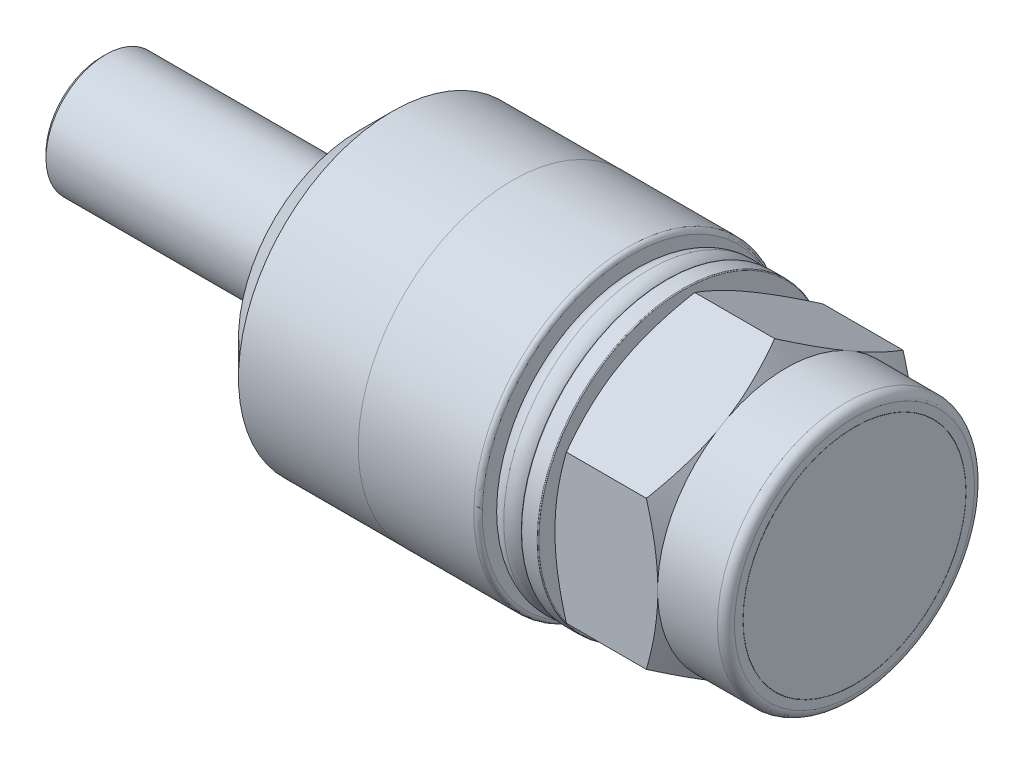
ISO-10303-21;
HEADER;
FILE_DESCRIPTION(('STEP AP214'),'2;1');
FILE_NAME('part.step','',(''),(''),'','','');
FILE_SCHEMA(('AUTOMOTIVE_DESIGN { 1 0 10303 214 1 1 1 1 }'));
ENDSEC;
DATA;
#1=APPLICATION_CONTEXT('core data for automotive mechanical design processes');
#2=APPLICATION_PROTOCOL_DEFINITION('international standard','automotive_design',2000,#1);
#3=PRODUCT_CONTEXT('',#1,'mechanical');
#4=PRODUCT('Part','Part','',(#3));
#5=PRODUCT_RELATED_PRODUCT_CATEGORY('part','',(#4));
#6=PRODUCT_DEFINITION_FORMATION('','',#4);
#7=PRODUCT_DEFINITION_CONTEXT('part definition',#1,'design');
#8=PRODUCT_DEFINITION('design','',#6,#7);
#9=PRODUCT_DEFINITION_SHAPE('','',#8);
#10=(LENGTH_UNIT() NAMED_UNIT(*) SI_UNIT(.MILLI.,.METRE.));
#11=(NAMED_UNIT(*) PLANE_ANGLE_UNIT() SI_UNIT($,.RADIAN.));
#12=(NAMED_UNIT(*) SI_UNIT($,.STERADIAN.) SOLID_ANGLE_UNIT());
#13=UNCERTAINTY_MEASURE_WITH_UNIT(LENGTH_MEASURE(1.E-05),#10,'distance_accuracy_value','');
#14=(GEOMETRIC_REPRESENTATION_CONTEXT(3) GLOBAL_UNCERTAINTY_ASSIGNED_CONTEXT((#13)) GLOBAL_UNIT_ASSIGNED_CONTEXT((#10,
#11,#12)) REPRESENTATION_CONTEXT('',''));
#15=CARTESIAN_POINT('',(0.,0.,0.));
#16=DIRECTION('',(0.,0.,1.));
#17=DIRECTION('',(1.,0.,0.));
#18=AXIS2_PLACEMENT_3D('',#15,#16,#17);
#19=CARTESIAN_POINT('',(9.00000000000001,4.33012701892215,-7.49999999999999));
#20=DIRECTION('',(0.,-0.866025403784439,0.5));
#21=DIRECTION('',(0.,-0.5,-0.866025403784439));
#22=AXIS2_PLACEMENT_3D('',#19,#20,#21);
#23=PLANE('',#22);
#24=CARTESIAN_POINT('',(5.95597458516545,1.31961290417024,-12.7143634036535));
#25=CARTESIAN_POINT('',(6.08318194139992,1.45568496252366,-12.4786796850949));
#26=CARTESIAN_POINT('',(6.20901899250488,1.5920822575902,-12.2424326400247));
#27=CARTESIAN_POINT('',(6.45730908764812,1.86566446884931,-11.7685743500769));
#28=CARTESIAN_POINT('',(6.57976170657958,2.00284948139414,-11.5309629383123));
#29=CARTESIAN_POINT('',(6.82099297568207,2.27855097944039,-11.0534339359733));
#30=CARTESIAN_POINT('',(6.9397586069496,2.41707032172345,-10.8135113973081));
#31=CARTESIAN_POINT('',(7.17232071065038,2.69514573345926,-10.331870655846));
#32=CARTESIAN_POINT('',(7.28611734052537,2.83470176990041,-10.090152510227));
#33=CARTESIAN_POINT('',(7.51047942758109,3.11859256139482,-9.59843923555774));
#34=CARTESIAN_POINT('',(7.62088834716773,3.26295838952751,-9.34839028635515));
#35=CARTESIAN_POINT('',(7.83385631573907,3.55314529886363,-8.84577181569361));
#36=CARTESIAN_POINT('',(7.93641498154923,3.69896645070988,-8.59320217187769));
#37=CARTESIAN_POINT('',(8.13173359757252,3.992098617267,-8.08548236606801));
#38=CARTESIAN_POINT('',(8.22450296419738,4.13940804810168,-7.8303349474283));
#39=CARTESIAN_POINT('',(8.39810468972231,4.43575641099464,-7.31704452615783));
#40=CARTESIAN_POINT('',(8.47893858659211,4.58479511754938,-7.05890191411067));
#41=CARTESIAN_POINT('',(8.65378901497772,4.94116549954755,-6.44165030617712));
#42=CARTESIAN_POINT('',(8.74131841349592,5.14932694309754,-6.08110410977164));
#43=CARTESIAN_POINT('',(8.84659548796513,5.46370761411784,-5.53658081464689));
#44=CARTESIAN_POINT('',(8.87735138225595,5.5688558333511,-5.3544587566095));
#45=CARTESIAN_POINT('',(8.92941808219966,5.77973065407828,-4.98921285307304));
#46=CARTESIAN_POINT('',(8.95073015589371,5.88545717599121,-4.8060891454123));
#47=CARTESIAN_POINT('',(8.9831127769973,6.0960729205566,-4.44129197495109));
#48=CARTESIAN_POINT('',(8.99429898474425,6.20095767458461,-4.25962625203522));
#49=CARTESIAN_POINT('',(9.0065172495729,6.41087547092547,-3.89603796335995));
#50=CARTESIAN_POINT('',(9.0075494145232,6.51590851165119,-3.71411540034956));
#51=CARTESIAN_POINT('',(8.99942691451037,6.72587489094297,-3.35044296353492));
#52=CARTESIAN_POINT('',(8.99027232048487,6.83080823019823,-3.16869308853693));
#53=CARTESIAN_POINT('',(8.96205356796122,7.04035198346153,-2.80575266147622));
#54=CARTESIAN_POINT('',(8.94298790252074,7.14496234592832,-2.62456219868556));
#55=CARTESIAN_POINT('',(8.88676676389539,7.39190729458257,-2.1968410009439));
#56=CARTESIAN_POINT('',(8.84554186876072,7.53401204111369,-1.95070835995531));
#57=CARTESIAN_POINT('',(8.74749630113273,7.8168660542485,-1.46079083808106));
#58=CARTESIAN_POINT('',(8.69067336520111,7.95761512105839,-1.21700630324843));
#59=CARTESIAN_POINT('',(8.56357626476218,8.23773861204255,-0.731818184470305));
#60=CARTESIAN_POINT('',(8.49328692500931,8.37711129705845,-0.490417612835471));
#61=CARTESIAN_POINT('',(8.34147196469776,8.6542940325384,-0.0103230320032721));
#62=CARTESIAN_POINT('',(8.25994705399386,8.79210418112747,0.228371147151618));
#63=CARTESIAN_POINT('',(8.08656939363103,9.06789407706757,0.70605325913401));
#64=CARTESIAN_POINT('',(7.99460469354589,9.20585610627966,0.945010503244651));
#65=CARTESIAN_POINT('',(7.80292838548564,9.48031836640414,1.42039308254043));
#66=CARTESIAN_POINT('',(7.70322191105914,9.61681949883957,1.65681997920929));
#67=CARTESIAN_POINT('',(7.49743393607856,9.88857702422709,2.12751782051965));
#68=CARTESIAN_POINT('',(7.39135377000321,10.0238336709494,2.36178920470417));
#69=CARTESIAN_POINT('',(7.17393317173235,10.2932853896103,2.82849327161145));
#70=CARTESIAN_POINT('',(7.06259264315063,10.4274804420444,3.06092592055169));
#71=CARTESIAN_POINT('',(6.8694955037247,10.6549683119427,3.45494646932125));
#72=CARTESIAN_POINT('',(6.78884444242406,10.7484967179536,3.61694242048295));
#73=CARTESIAN_POINT('',(6.62566439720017,10.9351392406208,3.94021675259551));
#74=CARTESIAN_POINT('',(6.54313547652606,11.0282533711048,4.10149515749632));
#75=CARTESIAN_POINT('',(6.37731158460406,11.213119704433,4.4216930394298));
#76=CARTESIAN_POINT('',(6.29403415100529,11.3048758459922,4.58061933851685));
#77=CARTESIAN_POINT('',(6.12603905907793,11.4880600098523,4.89790361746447));
#78=CARTESIAN_POINT('',(6.04132137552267,11.5794880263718,5.05626158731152));
#79=CARTESIAN_POINT('',(5.95597458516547,11.6707681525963,5.21436340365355));
#80=B_SPLINE_CURVE_WITH_KNOTS('',3,(#24,#25,#26,#27,#28,#29,#30,#31,#32,#33,#34,#35,#36,#37,#38,
#39,#40,#41,#42,#43,#44,#45,#46,#47,#48,#49,#50,#51,#52,#53,#54,#55,#56,#57,#58,#59,#60,#61,#62,
#63,#64,#65,#66,#67,#68,#69,#70,#71,#72,#73,#74,#75,#76,#77,#78,#79),.UNSPECIFIED.,.F.,.F.,(4,2,
2,2,2,2,2,2,2,2,2,2,2,2,2,2,2,2,2,2,2,2,2,2,2,2,2,4),(0.,0.901229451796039,1.80257159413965,
2.70679970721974,3.61099914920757,4.53827032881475,5.46558674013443,6.39200286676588,
7.31829951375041,8.59319156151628,9.23061651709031,9.86795585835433,10.4979199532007,
11.1278773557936,11.757830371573,12.3878791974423,13.2489099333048,14.1100656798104,
14.972197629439,15.8342751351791,16.7066724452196,17.5784961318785,18.4501379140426,
19.3217956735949,19.9328940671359,20.5439719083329,21.1485372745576,21.7531132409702),.UNSPECIFIED.);
#81=CARTESIAN_POINT('',(8.33604719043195,4.33012701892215,-7.49999999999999));
#82=VERTEX_POINT('',#81);
#83=CARTESIAN_POINT('',(9.00000000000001,6.29903006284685,-4.0897598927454));
#84=VERTEX_POINT('',#83);
#85=EDGE_CURVE('E222',#82,#84,#80,.T.);
#86=ORIENTED_EDGE('',*,*,#85,.F.);
#87=DIRECTION('',(-1.,0.,0.));
#88=VECTOR('',#87,1.);
#89=CARTESIAN_POINT('',(9.00000000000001,4.33012701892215,-7.49999999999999));
#90=LINE('',#89,#88);
#91=CARTESIAN_POINT('',(3.66395280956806,4.33012701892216,-7.49999999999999));
#92=VERTEX_POINT('',#91);
#93=EDGE_CURVE('E309',#82,#92,#90,.T.);
#94=ORIENTED_EDGE('',*,*,#93,.T.);
#95=CARTESIAN_POINT('',(6.04402541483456,11.6707681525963,5.21436340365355));
#96=CARTESIAN_POINT('',(5.9168180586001,11.5346960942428,4.97867968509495));
#97=CARTESIAN_POINT('',(5.79098100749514,11.3982987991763,4.74243264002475));
#98=CARTESIAN_POINT('',(5.5426909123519,11.1247165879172,4.26857435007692));
#99=CARTESIAN_POINT('',(5.42023829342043,10.9875315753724,4.0309629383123));
#100=CARTESIAN_POINT('',(5.17900702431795,10.7118300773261,3.55343393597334));
#101=CARTESIAN_POINT('',(5.06024139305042,10.573310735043,3.31351139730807));
#102=CARTESIAN_POINT('',(4.82767928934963,10.2952353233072,2.831870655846));
#103=CARTESIAN_POINT('',(4.71388265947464,10.1556792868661,2.590152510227));
#104=CARTESIAN_POINT('',(4.48952057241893,9.87178849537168,2.09843923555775));
#105=CARTESIAN_POINT('',(4.37911165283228,9.72742266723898,1.84839028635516));
#106=CARTESIAN_POINT('',(4.16614368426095,9.43723575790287,1.34577181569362));
#107=CARTESIAN_POINT('',(4.06358501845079,9.29141460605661,1.0932021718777));
#108=CARTESIAN_POINT('',(3.8682664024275,8.9982824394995,0.585482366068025));
#109=CARTESIAN_POINT('',(3.77549703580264,8.85097300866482,0.330334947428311));
#110=CARTESIAN_POINT('',(3.60189531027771,8.55462464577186,-0.182955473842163));
#111=CARTESIAN_POINT('',(3.5210614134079,8.40558593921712,-0.441098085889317));
#112=CARTESIAN_POINT('',(3.34621098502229,8.04921555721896,-1.05834969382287));
#113=CARTESIAN_POINT('',(3.25868158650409,7.84105411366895,-1.41889589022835));
#114=CARTESIAN_POINT('',(3.15340451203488,7.52667344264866,-1.96341918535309));
#115=CARTESIAN_POINT('',(3.12264861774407,7.42152522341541,-2.14554124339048));
#116=CARTESIAN_POINT('',(3.07058191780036,7.21065040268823,-2.51078714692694));
#117=CARTESIAN_POINT('',(3.0492698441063,7.10492388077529,-2.69391085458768));
#118=CARTESIAN_POINT('',(3.01688722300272,6.8943081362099,-3.05870802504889));
#119=CARTESIAN_POINT('',(3.00570101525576,6.78942338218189,-3.24037374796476));
#120=CARTESIAN_POINT('',(2.99348275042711,6.57950558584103,-3.60396203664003));
#121=CARTESIAN_POINT('',(2.99245058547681,6.47447254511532,-3.78588459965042));
#122=CARTESIAN_POINT('',(3.00057308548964,6.26450616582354,-4.14955703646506));
#123=CARTESIAN_POINT('',(3.00972767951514,6.15957282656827,-4.33130691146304));
#124=CARTESIAN_POINT('',(3.03794643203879,5.95002907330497,-4.69424733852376));
#125=CARTESIAN_POINT('',(3.05701209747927,5.84541871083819,-4.87543780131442));
#126=CARTESIAN_POINT('',(3.11323323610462,5.59847376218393,-5.30315899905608));
#127=CARTESIAN_POINT('',(3.15445813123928,5.45636901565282,-5.54929164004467));
#128=CARTESIAN_POINT('',(3.25250369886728,5.17351500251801,-6.03920916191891));
#129=CARTESIAN_POINT('',(3.30932663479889,5.03276593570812,-6.28299369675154));
#130=CARTESIAN_POINT('',(3.43642373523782,4.75264244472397,-6.76818181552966));
#131=CARTESIAN_POINT('',(3.50671307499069,4.61326975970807,-7.00958238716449));
#132=CARTESIAN_POINT('',(3.65852803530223,4.33608702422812,-7.48967696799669));
#133=CARTESIAN_POINT('',(3.74005294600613,4.19827687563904,-7.72837114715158));
#134=CARTESIAN_POINT('',(3.91343060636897,3.92248697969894,-8.20605325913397));
#135=CARTESIAN_POINT('',(4.0053953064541,3.78452495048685,-8.44501050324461));
#136=CARTESIAN_POINT('',(4.19707161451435,3.51006269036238,-8.92039308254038));
#137=CARTESIAN_POINT('',(4.29677808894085,3.37356155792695,-9.15681997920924));
#138=CARTESIAN_POINT('',(4.50256606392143,3.10180403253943,-9.6275178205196));
#139=CARTESIAN_POINT('',(4.60864622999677,2.96654738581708,-9.86178920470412));
#140=CARTESIAN_POINT('',(4.82606682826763,2.69709566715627,-10.3284932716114));
#141=CARTESIAN_POINT('',(4.93740735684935,2.56290061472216,-10.5609259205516));
#142=CARTESIAN_POINT('',(5.13050449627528,2.33541274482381,-10.9549464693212));
#143=CARTESIAN_POINT('',(5.21115555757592,2.24188433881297,-11.1169424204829));
#144=CARTESIAN_POINT('',(5.37433560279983,2.05524181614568,-11.4402167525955));
#145=CARTESIAN_POINT('',(5.45686452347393,1.96212768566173,-11.6014951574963));
#146=CARTESIAN_POINT('',(5.62268841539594,1.77726135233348,-11.9216930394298));
#147=CARTESIAN_POINT('',(5.70596584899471,1.68550521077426,-12.0806193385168));
#148=CARTESIAN_POINT('',(5.87396094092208,1.50232104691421,-12.3979036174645));
#149=CARTESIAN_POINT('',(5.95867862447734,1.41089303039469,-12.5562615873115));
#150=CARTESIAN_POINT('',(6.04402541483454,1.31961290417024,-12.7143634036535));
#151=B_SPLINE_CURVE_WITH_KNOTS('',3,(#95,#96,#97,#98,#99,#100,#101,#102,#103,#104,#105,#106,
#107,#108,#109,#110,#111,#112,#113,#114,#115,#116,#117,#118,#119,#120,#121,#122,#123,#124,#125,
#126,#127,#128,#129,#130,#131,#132,#133,#134,#135,#136,#137,#138,#139,#140,#141,#142,#143,#144,
#145,#146,#147,#148,#149,#150),.UNSPECIFIED.,.F.,.F.,(4,2,2,2,2,2,2,2,2,2,2,2,2,2,2,2,2,2,2,2,2,
2,2,2,2,2,2,4),(0.,0.901229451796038,1.80257159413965,2.70679970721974,3.61099914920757,
4.53827032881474,5.46558674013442,6.39200286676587,7.31829951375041,8.59319156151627,
9.2306165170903,9.86795585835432,10.4979199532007,11.1278773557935,11.757830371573,
12.3878791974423,13.2489099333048,14.1100656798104,14.9721976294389,15.834275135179,
16.7066724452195,17.5784961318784,18.4501379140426,19.3217956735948,19.9328940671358,
20.5439719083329,21.1485372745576,21.7531132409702),.UNSPECIFIED.);
#152=CARTESIAN_POINT('',(3.,6.29903006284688,-4.08975989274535));
#153=VERTEX_POINT('',#152);
#154=EDGE_CURVE('E467',#153,#92,#151,.T.);
#155=ORIENTED_EDGE('',*,*,#154,.F.);
#156=DIRECTION('',(0.,-0.5,-0.866025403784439));
#157=VECTOR('',#156,1.);
#158=CARTESIAN_POINT('',(3.00000000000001,8.60769052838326,-0.0910426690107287));
#159=LINE('',#158,#157);
#160=CARTESIAN_POINT('',(3.,6.69135099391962,-3.41024010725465));
#161=VERTEX_POINT('',#160);
#162=EDGE_CURVE('E396',#161,#153,#159,.T.);
#163=ORIENTED_EDGE('',*,*,#162,.F.);
#164=CARTESIAN_POINT('',(3.66395280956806,8.66025403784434,0.));
#165=VERTEX_POINT('',#164);
#166=EDGE_CURVE('E298',#165,#161,#151,.T.);
#167=ORIENTED_EDGE('',*,*,#166,.F.);
#168=DIRECTION('',(-1.,0.,0.));
#169=VECTOR('',#168,1.);
#170=CARTESIAN_POINT('',(9.00000000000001,8.66025403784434,0.));
#171=LINE('',#170,#169);
#172=CARTESIAN_POINT('',(8.33604719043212,8.66025403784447,-2.21868970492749E-13));
#173=VERTEX_POINT('',#172);
#174=EDGE_CURVE('E319',#173,#165,#171,.T.);
#175=ORIENTED_EDGE('',*,*,#174,.F.);
#176=CARTESIAN_POINT('',(9.00000000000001,6.69135099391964,-3.4102401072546));
#177=VERTEX_POINT('',#176);
#178=EDGE_CURVE('E434',#177,#173,#80,.T.);
#179=ORIENTED_EDGE('',*,*,#178,.F.);
#180=DIRECTION('',(0.,0.5,0.866025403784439));
#181=VECTOR('',#180,1.);
#182=CARTESIAN_POINT('',(9.00000000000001,4.33012701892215,-7.49999999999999));
#183=LINE('',#182,#181);
#184=EDGE_CURVE('E295',#84,#177,#183,.T.);
#185=ORIENTED_EDGE('',*,*,#184,.F.);
#186=EDGE_LOOP('',(#86,#94,#155,#163,#167,#175,#179,#185));
#187=FACE_BOUND('',#186,.T.);
#188=ADVANCED_FACE('F36',(#187),#23,.F.);
#189=CARTESIAN_POINT('',(9.00000000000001,8.66025403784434,0.));
#190=DIRECTION('',(0.,-0.866025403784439,-0.5));
#191=DIRECTION('',(0.,0.5,-0.866025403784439));
#192=AXIS2_PLACEMENT_3D('',#189,#190,#191);
#193=PLANE('',#192);
#194=CARTESIAN_POINT('',(5.95597458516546,11.6707681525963,-5.21436340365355));
#195=CARTESIAN_POINT('',(6.08318194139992,11.5346960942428,-4.97867968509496));
#196=CARTESIAN_POINT('',(6.20901899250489,11.3982987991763,-4.74243264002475));
#197=CARTESIAN_POINT('',(6.45730908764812,11.1247165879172,-4.26857435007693));
#198=CARTESIAN_POINT('',(6.57976170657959,10.9875315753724,-4.0309629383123));
#199=CARTESIAN_POINT('',(6.82099297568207,10.7118300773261,-3.55343393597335));
#200=CARTESIAN_POINT('',(6.9397586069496,10.573310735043,-3.31351139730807));
#201=CARTESIAN_POINT('',(7.17232071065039,10.2952353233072,-2.83187065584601));
#202=CARTESIAN_POINT('',(7.28611734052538,10.1556792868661,-2.590152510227));
#203=CARTESIAN_POINT('',(7.51047942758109,9.87178849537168,-2.09843923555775));
#204=CARTESIAN_POINT('',(7.62088834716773,9.72742266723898,-1.84839028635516));
#205=CARTESIAN_POINT('',(7.83385631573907,9.43723575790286,-1.34577181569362));
#206=CARTESIAN_POINT('',(7.93641498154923,9.29141460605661,-1.09320217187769));
#207=CARTESIAN_POINT('',(8.13173359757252,8.99828243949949,-0.585482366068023));
#208=CARTESIAN_POINT('',(8.22450296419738,8.85097300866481,-0.330334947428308));
#209=CARTESIAN_POINT('',(8.39810468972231,8.55462464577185,0.182955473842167));
#210=CARTESIAN_POINT('',(8.47893858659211,8.40558593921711,0.441098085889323));
#211=CARTESIAN_POINT('',(8.65378901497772,8.04921555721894,1.05834969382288));
#212=CARTESIAN_POINT('',(8.74131841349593,7.84105411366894,1.41889589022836));
#213=CARTESIAN_POINT('',(8.84659548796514,7.52667344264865,1.9634191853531));
#214=CARTESIAN_POINT('',(8.87735138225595,7.42152522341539,2.14554124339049));
#215=CARTESIAN_POINT('',(8.92941808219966,7.21065040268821,2.51078714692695));
#216=CARTESIAN_POINT('',(8.95073015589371,7.10492388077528,2.69391085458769));
#217=CARTESIAN_POINT('',(8.9831127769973,6.89430813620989,3.0587080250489));
#218=CARTESIAN_POINT('',(8.99429898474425,6.78942338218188,3.24037374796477));
#219=CARTESIAN_POINT('',(9.0065172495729,6.57950558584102,3.60396203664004));
#220=CARTESIAN_POINT('',(9.0075494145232,6.4744725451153,3.78588459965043));
#221=CARTESIAN_POINT('',(8.99942691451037,6.26450616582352,4.14955703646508));
#222=CARTESIAN_POINT('',(8.99027232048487,6.15957282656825,4.33130691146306));
#223=CARTESIAN_POINT('',(8.96205356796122,5.95002907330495,4.69424733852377));
#224=CARTESIAN_POINT('',(8.94298790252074,5.84541871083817,4.87543780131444));
#225=CARTESIAN_POINT('',(8.88676676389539,5.59847376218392,5.30315899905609));
#226=CARTESIAN_POINT('',(8.84554186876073,5.4563690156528,5.54929164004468));
#227=CARTESIAN_POINT('',(8.74749630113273,5.17351500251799,6.03920916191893));
#228=CARTESIAN_POINT('',(8.69067336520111,5.0327659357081,6.28299369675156));
#229=CARTESIAN_POINT('',(8.56357626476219,4.75264244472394,6.76818181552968));
#230=CARTESIAN_POINT('',(8.49328692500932,4.61326975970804,7.00958238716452));
#231=CARTESIAN_POINT('',(8.34147196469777,4.33608702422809,7.48967696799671));
#232=CARTESIAN_POINT('',(8.25994705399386,4.19827687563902,7.7283711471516));
#233=CARTESIAN_POINT('',(8.08656939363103,3.92248697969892,8.20605325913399));
#234=CARTESIAN_POINT('',(7.99460469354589,3.78452495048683,8.44501050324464));
#235=CARTESIAN_POINT('',(7.80292838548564,3.51006269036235,8.92039308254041));
#236=CARTESIAN_POINT('',(7.70322191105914,3.37356155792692,9.15681997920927));
#237=CARTESIAN_POINT('',(7.49743393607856,3.10180403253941,9.62751782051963));
#238=CARTESIAN_POINT('',(7.39135377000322,2.96654738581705,9.86178920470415));
#239=CARTESIAN_POINT('',(7.17393317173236,2.69709566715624,10.3284932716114));
#240=CARTESIAN_POINT('',(7.06259264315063,2.56290061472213,10.5609259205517));
#241=CARTESIAN_POINT('',(6.8694955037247,2.33541274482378,10.9549464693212));
#242=CARTESIAN_POINT('',(6.78884444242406,2.24188433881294,11.1169424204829));
#243=CARTESIAN_POINT('',(6.62566439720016,2.05524181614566,11.4402167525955));
#244=CARTESIAN_POINT('',(6.54313547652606,1.9621276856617,11.6014951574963));
#245=CARTESIAN_POINT('',(6.37731158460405,1.77726135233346,11.9216930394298));
#246=CARTESIAN_POINT('',(6.29403415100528,1.68550521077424,12.0806193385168));
#247=CARTESIAN_POINT('',(6.12603905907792,1.50232104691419,12.3979036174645));
#248=CARTESIAN_POINT('',(6.04132137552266,1.41089303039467,12.5562615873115));
#249=CARTESIAN_POINT('',(5.95597458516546,1.31961290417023,12.7143634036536));
#250=B_SPLINE_CURVE_WITH_KNOTS('',3,(#194,#195,#196,#197,#198,#199,#200,#201,#202,#203,#204,
#205,#206,#207,#208,#209,#210,#211,#212,#213,#214,#215,#216,#217,#218,#219,#220,#221,#222,#223,
#224,#225,#226,#227,#228,#229,#230,#231,#232,#233,#234,#235,#236,#237,#238,#239,#240,#241,#242,
#243,#244,#245,#246,#247,#248,#249),.UNSPECIFIED.,.F.,.F.,(4,2,2,2,2,2,2,2,2,2,2,2,2,2,2,2,2,2,
2,2,2,2,2,2,2,2,2,4),(0.,0.901229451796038,1.80257159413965,2.70679970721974,3.61099914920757,
4.53827032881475,5.46558674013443,6.39200286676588,7.31829951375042,8.59319156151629,
9.23061651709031,9.86795585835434,10.4979199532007,11.1278773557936,11.757830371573,
12.3878791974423,13.2489099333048,14.1100656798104,14.972197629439,15.8342751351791,
16.7066724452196,17.5784961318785,18.4501379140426,19.3217956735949,19.9328940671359,
20.543971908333,21.1485372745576,21.7531132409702),.UNSPECIFIED.);
#251=CARTESIAN_POINT('',(9.00000000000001,6.69135099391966,3.41024010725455));
#252=VERTEX_POINT('',#251);
#253=EDGE_CURVE('E439',#173,#252,#250,.T.);
#254=ORIENTED_EDGE('',*,*,#253,.F.);
#255=ORIENTED_EDGE('',*,*,#174,.T.);
#256=CARTESIAN_POINT('',(6.04402541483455,1.31961290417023,12.7143634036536));
#257=CARTESIAN_POINT('',(5.91681805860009,1.45568496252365,12.478679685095));
#258=CARTESIAN_POINT('',(5.79098100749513,1.59208225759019,12.2424326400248));
#259=CARTESIAN_POINT('',(5.54269091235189,1.8656644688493,11.7685743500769));
#260=CARTESIAN_POINT('',(5.42023829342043,2.00284948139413,11.5309629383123));
#261=CARTESIAN_POINT('',(5.17900702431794,2.27855097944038,11.0534339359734));
#262=CARTESIAN_POINT('',(5.06024139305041,2.41707032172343,10.8135113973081));
#263=CARTESIAN_POINT('',(4.82767928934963,2.69514573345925,10.331870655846));
#264=CARTESIAN_POINT('',(4.71388265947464,2.8347017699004,10.090152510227));
#265=CARTESIAN_POINT('',(4.48952057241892,3.1185925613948,9.59843923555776));
#266=CARTESIAN_POINT('',(4.37911165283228,3.2629583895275,9.34839028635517));
#267=CARTESIAN_POINT('',(4.16614368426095,3.55314529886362,8.84577181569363));
#268=CARTESIAN_POINT('',(4.06358501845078,3.69896645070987,8.5932021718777));
#269=CARTESIAN_POINT('',(3.8682664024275,3.99209861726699,8.08548236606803));
#270=CARTESIAN_POINT('',(3.77549703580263,4.13940804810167,7.83033494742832));
#271=CARTESIAN_POINT('',(3.6018953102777,4.43575641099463,7.31704452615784));
#272=CARTESIAN_POINT('',(3.5210614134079,4.58479511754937,7.05890191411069));
#273=CARTESIAN_POINT('',(3.34621098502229,4.94116549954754,6.44165030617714));
#274=CARTESIAN_POINT('',(3.25868158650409,5.14932694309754,6.08110410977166));
#275=CARTESIAN_POINT('',(3.15340451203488,5.46370761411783,5.53658081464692));
#276=CARTESIAN_POINT('',(3.12264861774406,5.56885583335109,5.35445875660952));
#277=CARTESIAN_POINT('',(3.07058191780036,5.77973065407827,4.98921285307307));
#278=CARTESIAN_POINT('',(3.0492698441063,5.8854571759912,4.80608914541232));
#279=CARTESIAN_POINT('',(3.01688722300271,6.09607292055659,4.44129197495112));
#280=CARTESIAN_POINT('',(3.00570101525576,6.2009576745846,4.25962625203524));
#281=CARTESIAN_POINT('',(2.99348275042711,6.41087547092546,3.89603796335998));
#282=CARTESIAN_POINT('',(2.99245058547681,6.51590851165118,3.71411540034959));
#283=CARTESIAN_POINT('',(3.00057308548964,6.72587489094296,3.35044296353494));
#284=CARTESIAN_POINT('',(3.00972767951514,6.83080823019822,3.16869308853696));
#285=CARTESIAN_POINT('',(3.03794643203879,7.04035198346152,2.80575266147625));
#286=CARTESIAN_POINT('',(3.05701209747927,7.1449623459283,2.62456219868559));
#287=CARTESIAN_POINT('',(3.11323323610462,7.39190729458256,2.19684100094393));
#288=CARTESIAN_POINT('',(3.15445813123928,7.53401204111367,1.95070835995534));
#289=CARTESIAN_POINT('',(3.25250369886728,7.81686605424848,1.4607908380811));
#290=CARTESIAN_POINT('',(3.30932663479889,7.95761512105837,1.21700630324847));
#291=CARTESIAN_POINT('',(3.43642373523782,8.23773861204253,0.731818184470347));
#292=CARTESIAN_POINT('',(3.50671307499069,8.37711129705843,0.490417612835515));
#293=CARTESIAN_POINT('',(3.65852803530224,8.65429403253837,0.0103230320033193));
#294=CARTESIAN_POINT('',(3.74005294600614,8.79210418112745,-0.228371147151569));
#295=CARTESIAN_POINT('',(3.91343060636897,9.06789407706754,-0.706053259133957));
#296=CARTESIAN_POINT('',(4.00539530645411,9.20585610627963,-0.945010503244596));
#297=CARTESIAN_POINT('',(4.19707161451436,9.48031836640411,-1.42039308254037));
#298=CARTESIAN_POINT('',(4.29677808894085,9.61681949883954,-1.65681997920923));
#299=CARTESIAN_POINT('',(4.50256606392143,9.88857702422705,-2.12751782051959));
#300=CARTESIAN_POINT('',(4.60864622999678,10.0238336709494,-2.36178920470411));
#301=CARTESIAN_POINT('',(4.82606682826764,10.2932853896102,-2.82849327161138));
#302=CARTESIAN_POINT('',(4.93740735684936,10.4274804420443,-3.06092592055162));
#303=CARTESIAN_POINT('',(5.13050449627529,10.6549683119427,-3.45494646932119));
#304=CARTESIAN_POINT('',(5.21115555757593,10.7484967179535,-3.6169424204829));
#305=CARTESIAN_POINT('',(5.37433560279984,10.9351392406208,-3.94021675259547));
#306=CARTESIAN_POINT('',(5.45686452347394,11.0282533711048,-4.10149515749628));
#307=CARTESIAN_POINT('',(5.62268841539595,11.213119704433,-4.42169303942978));
#308=CARTESIAN_POINT('',(5.70596584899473,11.3048758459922,-4.58061933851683));
#309=CARTESIAN_POINT('',(5.87396094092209,11.4880600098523,-4.89790361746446));
#310=CARTESIAN_POINT('',(5.95867862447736,11.5794880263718,-5.05626158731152));
#311=CARTESIAN_POINT('',(6.04402541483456,11.6707681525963,-5.21436340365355));
#312=B_SPLINE_CURVE_WITH_KNOTS('',3,(#256,#257,#258,#259,#260,#261,#262,#263,#264,#265,#266,
#267,#268,#269,#270,#271,#272,#273,#274,#275,#276,#277,#278,#279,#280,#281,#282,#283,#284,#285,
#286,#287,#288,#289,#290,#291,#292,#293,#294,#295,#296,#297,#298,#299,#300,#301,#302,#303,#304,
#305,#306,#307,#308,#309,#310,#311),.UNSPECIFIED.,.F.,.F.,(4,2,2,2,2,2,2,2,2,2,2,2,2,2,2,2,2,2,
2,2,2,2,2,2,2,2,2,4),(0.,0.901229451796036,1.80257159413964,2.70679970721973,3.61099914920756,
4.53827032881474,5.46558674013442,6.39200286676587,7.31829951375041,8.59319156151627,
9.2306165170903,9.86795585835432,10.4979199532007,11.1278773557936,11.757830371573,
12.3878791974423,13.2489099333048,14.1100656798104,14.9721976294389,15.834275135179,
16.7066724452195,17.5784961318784,18.4501379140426,19.3217956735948,19.9328940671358,
20.5439719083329,21.1485372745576,21.7531132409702),.UNSPECIFIED.);
#313=CARTESIAN_POINT('',(3.,6.69135099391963,3.41024010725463));
#314=VERTEX_POINT('',#313);
#315=EDGE_CURVE('E294',#314,#165,#312,.T.);
#316=ORIENTED_EDGE('',*,*,#315,.F.);
#317=DIRECTION('',(0.,0.5,-0.866025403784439));
#318=VECTOR('',#317,1.);
#319=CARTESIAN_POINT('',(3.00000000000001,8.60769052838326,0.0910426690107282));
#320=LINE('',#319,#318);
#321=CARTESIAN_POINT('',(3.,6.29903006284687,4.08975989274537));
#322=VERTEX_POINT('',#321);
#323=EDGE_CURVE('E393',#322,#314,#320,.T.);
#324=ORIENTED_EDGE('',*,*,#323,.F.);
#325=CARTESIAN_POINT('',(3.66395280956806,4.33012701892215,7.5));
#326=VERTEX_POINT('',#325);
#327=EDGE_CURVE('E289',#326,#322,#312,.T.);
#328=ORIENTED_EDGE('',*,*,#327,.F.);
#329=DIRECTION('',(-1.,0.,0.));
#330=VECTOR('',#329,1.);
#331=CARTESIAN_POINT('',(9.00000000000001,4.33012701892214,7.5));
#332=LINE('',#331,#330);
#333=CARTESIAN_POINT('',(8.33604719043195,4.33012701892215,7.5));
#334=VERTEX_POINT('',#333);
#335=EDGE_CURVE('E317',#334,#326,#332,.T.);
#336=ORIENTED_EDGE('',*,*,#335,.F.);
#337=CARTESIAN_POINT('',(9.00000000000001,6.29903006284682,4.08975989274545));
#338=VERTEX_POINT('',#337);
#339=EDGE_CURVE('E179',#338,#334,#250,.T.);
#340=ORIENTED_EDGE('',*,*,#339,.F.);
#341=DIRECTION('',(0.,-0.5,0.866025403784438));
#342=VECTOR('',#341,1.);
#343=CARTESIAN_POINT('',(9.00000000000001,8.66025403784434,0.));
#344=LINE('',#343,#342);
#345=EDGE_CURVE('E174',#252,#338,#344,.T.);
#346=ORIENTED_EDGE('',*,*,#345,.F.);
#347=EDGE_LOOP('',(#254,#255,#316,#324,#328,#336,#340,#346));
#348=FACE_BOUND('',#347,.T.);
#349=ADVANCED_FACE('F271',(#348),#193,.F.);
#350=CARTESIAN_POINT('',(9.00000000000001,4.33012701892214,7.5));
#351=DIRECTION('',(0.,0.,-1.));
#352=DIRECTION('',(0.,1.,0.));
#353=AXIS2_PLACEMENT_3D('',#350,#351,#352);
#354=PLANE('',#353);
#355=CARTESIAN_POINT('',(6.32778308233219,9.5444904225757,7.5));
#356=CARTESIAN_POINT('',(6.45076976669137,9.27350070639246,7.5));
#357=CARTESIAN_POINT('',(6.57215586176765,9.00177048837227,7.5));
#358=CARTESIAN_POINT('',(6.81095033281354,8.45651182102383,7.5));
#359=CARTESIAN_POINT('',(6.92835798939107,8.18298305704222,7.5));
#360=CARTESIAN_POINT('',(7.15885357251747,7.63276310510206,7.5));
#361=CARTESIAN_POINT('',(7.27192145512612,7.35606348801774,7.5));
#362=CARTESIAN_POINT('',(7.49214488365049,6.80032713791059,7.5));
#363=CARTESIAN_POINT('',(7.59930070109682,6.52129051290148,7.5));
#364=CARTESIAN_POINT('',(7.80592563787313,5.96177591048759,7.5));
#365=CARTESIAN_POINT('',(7.90542668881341,5.68130978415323,7.5));
#366=CARTESIAN_POINT('',(8.09565207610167,5.11738100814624,7.5));
#367=CARTESIAN_POINT('',(8.18637597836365,4.83391821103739,7.5));
#368=CARTESIAN_POINT('',(8.35696879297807,4.2641423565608,7.5));
#369=CARTESIAN_POINT('',(8.43685234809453,3.97783371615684,7.5));
#370=CARTESIAN_POINT('',(8.58364289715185,3.40187478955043,7.5));
#371=CARTESIAN_POINT('',(8.65055045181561,3.11222464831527,7.5));
#372=CARTESIAN_POINT('',(8.75217161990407,2.61226236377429,7.5));
#373=CARTESIAN_POINT('',(8.79063641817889,2.40271234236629,7.5));
#374=CARTESIAN_POINT('',(8.85875489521,1.98220634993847,7.5));
#375=CARTESIAN_POINT('',(8.8884100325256,1.77125061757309,7.5));
#376=CARTESIAN_POINT('',(8.93813478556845,1.34824313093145,7.5));
#377=CARTESIAN_POINT('',(8.95820617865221,1.13619158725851,7.5));
#378=CARTESIAN_POINT('',(8.98818927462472,0.711364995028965,7.5));
#379=CARTESIAN_POINT('',(8.99810100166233,0.49858994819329,7.5));
#380=CARTESIAN_POINT('',(9.00745576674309,0.0729190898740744,7.5));
#381=CARTESIAN_POINT('',(9.00690428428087,-0.139976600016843,7.5));
#382=CARTESIAN_POINT('',(8.99536368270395,-0.565480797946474,7.5));
#383=CARTESIAN_POINT('',(8.98437461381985,-0.778089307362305,7.5));
#384=CARTESIAN_POINT('',(8.95229447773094,-1.20255831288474,7.5));
#385=CARTESIAN_POINT('',(8.93120239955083,-1.41441873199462,7.5));
#386=CARTESIAN_POINT('',(8.87952367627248,-1.83697246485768,7.5));
#387=CARTESIAN_POINT('',(8.84893663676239,-2.04766572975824,7.5));
#388=CARTESIAN_POINT('',(8.76149765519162,-2.57307255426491,7.5));
#389=CARTESIAN_POINT('',(8.69917001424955,-2.88687914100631,7.5));
#390=CARTESIAN_POINT('',(8.55787460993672,-3.51073649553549,7.5));
#391=CARTESIAN_POINT('',(8.47890246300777,-3.82078625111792,7.5));
#392=CARTESIAN_POINT('',(8.30712303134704,-4.43772902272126,7.5));
#393=CARTESIAN_POINT('',(8.21428561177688,-4.74461356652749,7.5));
#394=CARTESIAN_POINT('',(8.01754498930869,-5.3547588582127,7.5));
#395=CARTESIAN_POINT('',(7.91364256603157,-5.65801985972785,7.5));
#396=CARTESIAN_POINT('',(7.69569251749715,-6.26481274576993,7.5));
#397=CARTESIAN_POINT('',(7.5815415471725,-6.56830727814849,7.5));
#398=CARTESIAN_POINT('',(7.34592978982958,-7.17245366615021,7.5));
#399=CARTESIAN_POINT('',(7.22446854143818,-7.47310534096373,7.5));
#400=CARTESIAN_POINT('',(6.97644876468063,-8.07008523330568,7.5));
#401=CARTESIAN_POINT('',(6.8499268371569,-8.36642872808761,7.5));
#402=CARTESIAN_POINT('',(6.59215096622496,-8.95696632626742,7.5));
#403=CARTESIAN_POINT('',(6.46089820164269,-9.25116094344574,7.5));
#404=CARTESIAN_POINT('',(6.32778308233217,-9.54449042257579,7.5));
#405=B_SPLINE_CURVE_WITH_KNOTS('',3,(#355,#356,#357,#358,#359,#360,#361,#362,#363,#364,#365,
#366,#367,#368,#369,#370,#371,#372,#373,#374,#375,#376,#377,#378,#379,#380,#381,#382,#383,#384,
#385,#386,#387,#388,#389,#390,#391,#392,#393,#394,#395,#396,#397,#398,#399,#400,#401,#402,#403,
#404),.UNSPECIFIED.,.F.,.F.,(4,2,2,2,2,2,2,2,2,2,2,2,2,2,2,2,2,2,2,2,2,2,2,2,4),(0.,
0.892790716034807,1.78574201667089,2.68241508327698,3.57904693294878,4.47170903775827,
5.36441526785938,6.25590339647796,7.14735299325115,7.78634350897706,8.42522817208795,
9.06399430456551,9.70275891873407,10.3411890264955,10.9796160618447,11.618106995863,
12.2566244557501,13.2158534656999,14.175335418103,15.1369339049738,16.0984646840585,
17.0711047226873,18.0438062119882,19.010428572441,19.9768117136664),.UNSPECIFIED.);
#406=CARTESIAN_POINT('',(9.00000000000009,0.392320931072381,7.50000000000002));
#407=VERTEX_POINT('',#406);
#408=EDGE_CURVE('E166',#334,#407,#405,.T.);
#409=ORIENTED_EDGE('',*,*,#408,.F.);
#410=ORIENTED_EDGE('',*,*,#335,.T.);
#411=CARTESIAN_POINT('',(5.67221691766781,-9.5444904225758,7.5));
#412=CARTESIAN_POINT('',(5.54923023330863,-9.27350070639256,7.5));
#413=CARTESIAN_POINT('',(5.42784413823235,-9.00177048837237,7.5));
#414=CARTESIAN_POINT('',(5.18904966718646,-8.45651182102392,7.5));
#415=CARTESIAN_POINT('',(5.07164201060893,-8.18298305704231,7.5));
#416=CARTESIAN_POINT('',(4.84114642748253,-7.63276310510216,7.5));
#417=CARTESIAN_POINT('',(4.72807854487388,-7.35606348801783,7.5));
#418=CARTESIAN_POINT('',(4.50785511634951,-6.80032713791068,7.5));
#419=CARTESIAN_POINT('',(4.40069929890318,-6.52129051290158,7.5));
#420=CARTESIAN_POINT('',(4.19407436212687,-5.96177591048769,7.5));
#421=CARTESIAN_POINT('',(4.09457331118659,-5.68130978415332,7.5));
#422=CARTESIAN_POINT('',(3.90434792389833,-5.11738100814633,7.5));
#423=CARTESIAN_POINT('',(3.81362402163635,-4.83391821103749,7.5));
#424=CARTESIAN_POINT('',(3.64303120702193,-4.2641423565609,7.5));
#425=CARTESIAN_POINT('',(3.56314765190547,-3.97783371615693,7.5));
#426=CARTESIAN_POINT('',(3.41635710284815,-3.40187478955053,7.5));
#427=CARTESIAN_POINT('',(3.34944954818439,-3.11222464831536,7.5));
#428=CARTESIAN_POINT('',(3.24782838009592,-2.61226236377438,7.5));
#429=CARTESIAN_POINT('',(3.20936358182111,-2.40271234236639,7.5));
#430=CARTESIAN_POINT('',(3.14124510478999,-1.98220634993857,7.5));
#431=CARTESIAN_POINT('',(3.1115899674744,-1.77125061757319,7.5));
#432=CARTESIAN_POINT('',(3.06186521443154,-1.34824313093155,7.5));
#433=CARTESIAN_POINT('',(3.04179382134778,-1.13619158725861,7.5));
#434=CARTESIAN_POINT('',(3.01181072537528,-0.711364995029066,7.5));
#435=CARTESIAN_POINT('',(3.00189899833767,-0.498589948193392,7.5));
#436=CARTESIAN_POINT('',(2.99254423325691,-0.0729190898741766,7.5));
#437=CARTESIAN_POINT('',(2.99309571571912,0.13997660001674,7.5));
#438=CARTESIAN_POINT('',(3.00463631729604,0.565480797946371,7.5));
#439=CARTESIAN_POINT('',(3.01562538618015,0.778089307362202,7.5));
#440=CARTESIAN_POINT('',(3.04770552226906,1.20255831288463,7.5));
#441=CARTESIAN_POINT('',(3.06879760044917,1.41441873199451,7.5));
#442=CARTESIAN_POINT('',(3.12047632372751,1.83697246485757,7.5));
#443=CARTESIAN_POINT('',(3.1510633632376,2.04766572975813,7.5));
#444=CARTESIAN_POINT('',(3.23850234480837,2.5730725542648,7.5));
#445=CARTESIAN_POINT('',(3.30082998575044,2.88687914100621,7.5));
#446=CARTESIAN_POINT('',(3.44212539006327,3.51073649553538,7.5));
#447=CARTESIAN_POINT('',(3.52109753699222,3.82078625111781,7.5));
#448=CARTESIAN_POINT('',(3.69287696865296,4.43772902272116,7.5));
#449=CARTESIAN_POINT('',(3.78571438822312,4.74461356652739,7.5));
#450=CARTESIAN_POINT('',(3.9824550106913,5.3547588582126,7.5));
#451=CARTESIAN_POINT('',(4.08635743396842,5.65801985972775,7.5));
#452=CARTESIAN_POINT('',(4.30430748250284,6.26481274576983,7.5));
#453=CARTESIAN_POINT('',(4.41845845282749,6.56830727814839,7.5));
#454=CARTESIAN_POINT('',(4.65407021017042,7.17245366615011,7.5));
#455=CARTESIAN_POINT('',(4.77553145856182,7.47310534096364,7.5));
#456=CARTESIAN_POINT('',(5.02355123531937,8.07008523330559,7.5));
#457=CARTESIAN_POINT('',(5.15007316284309,8.36642872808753,7.5));
#458=CARTESIAN_POINT('',(5.40784903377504,8.95696632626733,7.5));
#459=CARTESIAN_POINT('',(5.53910179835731,9.25116094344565,7.5));
#460=CARTESIAN_POINT('',(5.67221691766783,9.54449042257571,7.5));
#461=B_SPLINE_CURVE_WITH_KNOTS('',3,(#411,#412,#413,#414,#415,#416,#417,#418,#419,#420,#421,
#422,#423,#424,#425,#426,#427,#428,#429,#430,#431,#432,#433,#434,#435,#436,#437,#438,#439,#440,
#441,#442,#443,#444,#445,#446,#447,#448,#449,#450,#451,#452,#453,#454,#455,#456,#457,#458,#459,
#460),.UNSPECIFIED.,.F.,.F.,(4,2,2,2,2,2,2,2,2,2,2,2,2,2,2,2,2,2,2,2,2,2,2,2,4),(0.,
0.892790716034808,1.78574201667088,2.68241508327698,3.57904693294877,4.47170903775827,
5.36441526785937,6.25590339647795,7.14735299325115,7.78634350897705,8.42522817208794,
9.0639943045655,9.70275891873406,10.3411890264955,10.9796160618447,11.618106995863,
12.2566244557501,13.2158534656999,14.1753354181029,15.1369339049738,16.0984646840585,
17.0711047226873,18.0438062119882,19.010428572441,19.9768117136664),.UNSPECIFIED.);
#462=CARTESIAN_POINT('',(3.,0.392320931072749,7.5));
#463=VERTEX_POINT('',#462);
#464=EDGE_CURVE('E282',#463,#326,#461,.T.);
#465=ORIENTED_EDGE('',*,*,#464,.F.);
#466=DIRECTION('',(0.,1.,0.));
#467=VECTOR('',#466,1.);
#468=CARTESIAN_POINT('',(3.00000000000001,8.45,7.5));
#469=LINE('',#468,#467);
#470=CARTESIAN_POINT('',(3.,-0.392320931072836,7.5));
#471=VERTEX_POINT('',#470);
#472=EDGE_CURVE('E390',#471,#463,#469,.T.);
#473=ORIENTED_EDGE('',*,*,#472,.F.);
#474=CARTESIAN_POINT('',(3.66395280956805,-4.33012701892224,7.5));
#475=VERTEX_POINT('',#474);
#476=EDGE_CURVE('E276',#475,#471,#461,.T.);
#477=ORIENTED_EDGE('',*,*,#476,.F.);
#478=DIRECTION('',(-1.,0.,0.));
#479=VECTOR('',#478,1.);
#480=CARTESIAN_POINT('',(8.99999999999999,-4.33012701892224,7.5));
#481=LINE('',#480,#479);
#482=CARTESIAN_POINT('',(8.33604719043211,-4.33012701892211,7.50000000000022));
#483=VERTEX_POINT('',#482);
#484=EDGE_CURVE('E315',#483,#475,#481,.T.);
#485=ORIENTED_EDGE('',*,*,#484,.F.);
#486=CARTESIAN_POINT('',(9.,-0.392320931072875,7.5));
#487=VERTEX_POINT('',#486);
#488=EDGE_CURVE('E169',#487,#483,#405,.T.);
#489=ORIENTED_EDGE('',*,*,#488,.F.);
#490=DIRECTION('',(0.,-1.,0.));
#491=VECTOR('',#490,1.);
#492=CARTESIAN_POINT('',(9.00000000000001,4.33012701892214,7.5));
#493=LINE('',#492,#491);
#494=EDGE_CURVE('E163',#407,#487,#493,.T.);
#495=ORIENTED_EDGE('',*,*,#494,.F.);
#496=EDGE_LOOP('',(#409,#410,#465,#473,#477,#485,#489,#495));
#497=FACE_BOUND('',#496,.T.);
#498=ADVANCED_FACE('F165',(#497),#354,.F.);
#499=CARTESIAN_POINT('',(8.99999999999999,-4.33012701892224,7.5));
#500=DIRECTION('',(0.,0.866025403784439,-0.5));
#501=DIRECTION('',(0.,0.5,0.866025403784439));
#502=AXIS2_PLACEMENT_3D('',#499,#500,#501);
#503=PLANE('',#502);
#504=CARTESIAN_POINT('',(5.95597458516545,-1.31961290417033,12.7143634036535));
#505=CARTESIAN_POINT('',(6.08318194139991,-1.45568496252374,12.478679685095));
#506=CARTESIAN_POINT('',(6.20901899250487,-1.59208225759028,12.2424326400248));
#507=CARTESIAN_POINT('',(6.45730908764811,-1.86566446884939,11.7685743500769));
#508=CARTESIAN_POINT('',(6.57976170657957,-2.00284948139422,11.5309629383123));
#509=CARTESIAN_POINT('',(6.82099297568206,-2.27855097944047,11.0534339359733));
#510=CARTESIAN_POINT('',(6.93975860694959,-2.41707032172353,10.8135113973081));
#511=CARTESIAN_POINT('',(7.17232071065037,-2.69514573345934,10.331870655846));
#512=CARTESIAN_POINT('',(7.28611734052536,-2.83470176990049,10.090152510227));
#513=CARTESIAN_POINT('',(7.51047942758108,-3.1185925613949,9.59843923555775));
#514=CARTESIAN_POINT('',(7.62088834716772,-3.2629583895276,9.34839028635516));
#515=CARTESIAN_POINT('',(7.83385631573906,-3.55314529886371,8.84577181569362));
#516=CARTESIAN_POINT('',(7.93641498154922,-3.69896645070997,8.5932021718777));
#517=CARTESIAN_POINT('',(8.1317335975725,-3.99209861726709,8.08548236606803));
#518=CARTESIAN_POINT('',(8.22450296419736,-4.13940804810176,7.83033494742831));
#519=CARTESIAN_POINT('',(8.3981046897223,-4.43575641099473,7.31704452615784));
#520=CARTESIAN_POINT('',(8.4789385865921,-4.58479511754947,7.05890191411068));
#521=CARTESIAN_POINT('',(8.65378901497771,-4.94116549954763,6.44165030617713));
#522=CARTESIAN_POINT('',(8.74131841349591,-5.14932694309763,6.08110410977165));
#523=CARTESIAN_POINT('',(8.84659548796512,-5.46370761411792,5.53658081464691));
#524=CARTESIAN_POINT('',(8.87735138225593,-5.56885583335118,5.35445875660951));
#525=CARTESIAN_POINT('',(8.92941808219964,-5.77973065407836,4.98921285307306));
#526=CARTESIAN_POINT('',(8.9507301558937,-5.8854571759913,4.80608914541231));
#527=CARTESIAN_POINT('',(8.98311277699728,-6.09607292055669,4.4412919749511));
#528=CARTESIAN_POINT('',(8.99429898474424,-6.20095767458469,4.25962625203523));
#529=CARTESIAN_POINT('',(9.00651724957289,-6.41087547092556,3.89603796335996));
#530=CARTESIAN_POINT('',(9.00754941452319,-6.51590851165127,3.71411540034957));
#531=CARTESIAN_POINT('',(8.99942691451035,-6.72587489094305,3.35044296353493));
#532=CARTESIAN_POINT('',(8.99027232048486,-6.83080823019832,3.16869308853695));
#533=CARTESIAN_POINT('',(8.96205356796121,-7.04035198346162,2.80575266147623));
#534=CARTESIAN_POINT('',(8.94298790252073,-7.1449623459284,2.62456219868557));
#535=CARTESIAN_POINT('',(8.88676676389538,-7.39190729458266,2.19684100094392));
#536=CARTESIAN_POINT('',(8.84554186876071,-7.53401204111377,1.95070835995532));
#537=CARTESIAN_POINT('',(8.74749630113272,-7.81686605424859,1.46079083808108));
#538=CARTESIAN_POINT('',(8.6906733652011,-7.95761512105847,1.21700630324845));
#539=CARTESIAN_POINT('',(8.56357626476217,-8.23773861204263,0.731818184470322));
#540=CARTESIAN_POINT('',(8.4932869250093,-8.37711129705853,0.49041761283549));
#541=CARTESIAN_POINT('',(8.34147196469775,-8.65429403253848,0.0103230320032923));
#542=CARTESIAN_POINT('',(8.25994705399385,-8.79210418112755,-0.228371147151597));
#543=CARTESIAN_POINT('',(8.08656939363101,-9.06789407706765,-0.706053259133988));
#544=CARTESIAN_POINT('',(7.99460469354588,-9.20585610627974,-0.945010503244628));
#545=CARTESIAN_POINT('',(7.80292838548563,-9.48031836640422,-1.42039308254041));
#546=CARTESIAN_POINT('',(7.70322191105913,-9.61681949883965,-1.65681997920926));
#547=CARTESIAN_POINT('',(7.49743393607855,-9.88857702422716,-2.12751782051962));
#548=CARTESIAN_POINT('',(7.39135377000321,-10.0238336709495,-2.36178920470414));
#549=CARTESIAN_POINT('',(7.17393317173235,-10.2932853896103,-2.82849327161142));
#550=CARTESIAN_POINT('',(7.06259264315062,-10.4274804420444,-3.06092592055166));
#551=CARTESIAN_POINT('',(6.86949550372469,-10.6549683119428,-3.45494646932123));
#552=CARTESIAN_POINT('',(6.78884444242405,-10.7484967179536,-3.61694242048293));
#553=CARTESIAN_POINT('',(6.62566439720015,-10.9351392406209,-3.9402167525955));
#554=CARTESIAN_POINT('',(6.54313547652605,-11.0282533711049,-4.1014951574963));
#555=CARTESIAN_POINT('',(6.37731158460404,-11.2131197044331,-4.4216930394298));
#556=CARTESIAN_POINT('',(6.29403415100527,-11.3048758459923,-4.58061933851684));
#557=CARTESIAN_POINT('',(6.12603905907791,-11.4880600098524,-4.89790361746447));
#558=CARTESIAN_POINT('',(6.04132137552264,-11.5794880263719,-5.05626158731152));
#559=CARTESIAN_POINT('',(5.95597458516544,-11.6707681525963,-5.21436340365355));
#560=B_SPLINE_CURVE_WITH_KNOTS('',3,(#504,#505,#506,#507,#508,#509,#510,#511,#512,#513,#514,
#515,#516,#517,#518,#519,#520,#521,#522,#523,#524,#525,#526,#527,#528,#529,#530,#531,#532,#533,
#534,#535,#536,#537,#538,#539,#540,#541,#542,#543,#544,#545,#546,#547,#548,#549,#550,#551,#552,
#553,#554,#555,#556,#557,#558,#559),.UNSPECIFIED.,.F.,.F.,(4,2,2,2,2,2,2,2,2,2,2,2,2,2,2,2,2,2,
2,2,2,2,2,2,2,2,2,4),(0.,0.901229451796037,1.80257159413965,2.70679970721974,3.61099914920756,
4.53827032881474,5.46558674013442,6.39200286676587,7.31829951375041,8.59319156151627,
9.2306165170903,9.86795585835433,10.4979199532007,11.1278773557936,11.757830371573,
12.3878791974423,13.2489099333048,14.1100656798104,14.9721976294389,15.834275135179,
16.7066724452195,17.5784961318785,18.4501379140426,19.3217956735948,19.9328940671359,
20.543971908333,21.1485372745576,21.7531132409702),.UNSPECIFIED.);
#561=CARTESIAN_POINT('',(8.99999999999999,-6.29903006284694,4.0897598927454));
#562=VERTEX_POINT('',#561);
#563=EDGE_CURVE('E262',#483,#562,#560,.T.);
#564=ORIENTED_EDGE('',*,*,#563,.F.);
#565=ORIENTED_EDGE('',*,*,#484,.T.);
#566=CARTESIAN_POINT('',(6.04402541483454,-11.6707681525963,-5.21436340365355));
#567=CARTESIAN_POINT('',(5.91681805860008,-11.5346960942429,-4.97867968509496));
#568=CARTESIAN_POINT('',(5.79098100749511,-11.3982987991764,-4.74243264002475));
#569=CARTESIAN_POINT('',(5.54269091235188,-11.1247165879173,-4.26857435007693));
#570=CARTESIAN_POINT('',(5.42023829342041,-10.9875315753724,-4.03096293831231));
#571=CARTESIAN_POINT('',(5.17900702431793,-10.7118300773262,-3.55343393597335));
#572=CARTESIAN_POINT('',(5.0602413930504,-10.5733107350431,-3.31351139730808));
#573=CARTESIAN_POINT('',(4.82767928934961,-10.2952353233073,-2.83187065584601));
#574=CARTESIAN_POINT('',(4.71388265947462,-10.1556792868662,-2.59015251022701));
#575=CARTESIAN_POINT('',(4.48952057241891,-9.87178849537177,-2.09843923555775));
#576=CARTESIAN_POINT('',(4.37911165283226,-9.72742266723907,-1.84839028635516));
#577=CARTESIAN_POINT('',(4.16614368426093,-9.43723575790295,-1.34577181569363));
#578=CARTESIAN_POINT('',(4.06358501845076,-9.2914146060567,-1.0932021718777));
#579=CARTESIAN_POINT('',(3.86826640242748,-8.99828243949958,-0.585482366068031));
#580=CARTESIAN_POINT('',(3.77549703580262,-8.8509730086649,-0.330334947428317));
#581=CARTESIAN_POINT('',(3.60189531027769,-8.55462464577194,0.182955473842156));
#582=CARTESIAN_POINT('',(3.52106141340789,-8.4055859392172,0.44109808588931));
#583=CARTESIAN_POINT('',(3.34621098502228,-8.04921555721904,1.05834969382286));
#584=CARTESIAN_POINT('',(3.25868158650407,-7.84105411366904,1.41889589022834));
#585=CARTESIAN_POINT('',(3.15340451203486,-7.52667344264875,1.96341918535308));
#586=CARTESIAN_POINT('',(3.12264861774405,-7.42152522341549,2.14554124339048));
#587=CARTESIAN_POINT('',(3.07058191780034,-7.21065040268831,2.51078714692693));
#588=CARTESIAN_POINT('',(3.04926984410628,-7.10492388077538,2.69391085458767));
#589=CARTESIAN_POINT('',(3.0168872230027,-6.89430813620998,3.05870802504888));
#590=CARTESIAN_POINT('',(3.00570101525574,-6.78942338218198,3.24037374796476));
#591=CARTESIAN_POINT('',(2.9934827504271,-6.57950558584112,3.60396203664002));
#592=CARTESIAN_POINT('',(2.99245058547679,-6.4744725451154,3.78588459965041));
#593=CARTESIAN_POINT('',(3.00057308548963,-6.26450616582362,4.14955703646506));
#594=CARTESIAN_POINT('',(3.00972767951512,-6.15957282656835,4.33130691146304));
#595=CARTESIAN_POINT('',(3.03794643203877,-5.95002907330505,4.69424733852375));
#596=CARTESIAN_POINT('',(3.05701209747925,-5.84541871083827,4.87543780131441));
#597=CARTESIAN_POINT('',(3.1132332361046,-5.59847376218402,5.30315899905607));
#598=CARTESIAN_POINT('',(3.15445813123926,-5.4563690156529,5.54929164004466));
#599=CARTESIAN_POINT('',(3.25250369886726,-5.17351500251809,6.0392091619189));
#600=CARTESIAN_POINT('',(3.30932663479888,-5.03276593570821,6.28299369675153));
#601=CARTESIAN_POINT('',(3.4364237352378,-4.75264244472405,6.76818181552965));
#602=CARTESIAN_POINT('',(3.50671307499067,-4.61326975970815,7.00958238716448));
#603=CARTESIAN_POINT('',(3.65852803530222,-4.3360870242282,7.48967696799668));
#604=CARTESIAN_POINT('',(3.74005294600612,-4.19827687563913,7.72837114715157));
#605=CARTESIAN_POINT('',(3.91343060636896,-3.92248697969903,8.20605325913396));
#606=CARTESIAN_POINT('',(4.00539530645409,-3.78452495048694,8.4450105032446));
#607=CARTESIAN_POINT('',(4.19707161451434,-3.51006269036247,8.92039308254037));
#608=CARTESIAN_POINT('',(4.29677808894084,-3.37356155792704,9.15681997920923));
#609=CARTESIAN_POINT('',(4.50256606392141,-3.10180403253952,9.62751782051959));
#610=CARTESIAN_POINT('',(4.60864622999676,-2.96654738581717,9.86178920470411));
#611=CARTESIAN_POINT('',(4.82606682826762,-2.69709566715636,10.3284932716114));
#612=CARTESIAN_POINT('',(4.93740735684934,-2.56290061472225,10.5609259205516));
#613=CARTESIAN_POINT('',(5.13050449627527,-2.3354127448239,10.9549464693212));
#614=CARTESIAN_POINT('',(5.21115555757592,-2.24188433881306,11.1169424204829));
#615=CARTESIAN_POINT('',(5.37433560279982,-2.05524181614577,11.4402167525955));
#616=CARTESIAN_POINT('',(5.45686452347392,-1.96212768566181,11.6014951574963));
#617=CARTESIAN_POINT('',(5.62268841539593,-1.77726135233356,11.9216930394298));
#618=CARTESIAN_POINT('',(5.70596584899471,-1.68550521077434,12.0806193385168));
#619=CARTESIAN_POINT('',(5.87396094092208,-1.50232104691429,12.3979036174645));
#620=CARTESIAN_POINT('',(5.95867862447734,-1.41089303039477,12.5562615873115));
#621=CARTESIAN_POINT('',(6.04402541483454,-1.31961290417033,12.7143634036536));
#622=B_SPLINE_CURVE_WITH_KNOTS('',3,(#566,#567,#568,#569,#570,#571,#572,#573,#574,#575,#576,
#577,#578,#579,#580,#581,#582,#583,#584,#585,#586,#587,#588,#589,#590,#591,#592,#593,#594,#595,
#596,#597,#598,#599,#600,#601,#602,#603,#604,#605,#606,#607,#608,#609,#610,#611,#612,#613,#614,
#615,#616,#617,#618,#619,#620,#621),.UNSPECIFIED.,.F.,.F.,(4,2,2,2,2,2,2,2,2,2,2,2,2,2,2,2,2,2,
2,2,2,2,2,2,2,2,2,4),(0.,0.901229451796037,1.80257159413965,2.70679970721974,3.61099914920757,
4.53827032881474,5.46558674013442,6.39200286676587,7.31829951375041,8.59319156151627,
9.2306165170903,9.86795585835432,10.4979199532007,11.1278773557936,11.757830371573,
12.3878791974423,13.2489099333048,14.1100656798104,14.9721976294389,15.834275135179,
16.7066724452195,17.5784961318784,18.4501379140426,19.3217956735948,19.9328940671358,
20.5439719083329,21.1485372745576,21.7531132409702),.UNSPECIFIED.);
#623=CARTESIAN_POINT('',(2.99999999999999,-6.29903006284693,4.0897598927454));
#624=VERTEX_POINT('',#623);
#625=EDGE_CURVE('E283',#624,#475,#622,.T.);
#626=ORIENTED_EDGE('',*,*,#625,.F.);
#627=DIRECTION('',(0.,0.5,0.866025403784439));
#628=VECTOR('',#627,1.);
#629=CARTESIAN_POINT('',(2.99999999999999,-4.38269052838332,7.40895733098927));
#630=LINE('',#629,#628);
#631=CARTESIAN_POINT('',(2.99999999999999,-6.69135099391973,3.4102401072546));
#632=VERTEX_POINT('',#631);
#633=EDGE_CURVE('E387',#632,#624,#630,.T.);
#634=ORIENTED_EDGE('',*,*,#633,.F.);
#635=CARTESIAN_POINT('',(3.66395280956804,-8.66025403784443,0.));
#636=VERTEX_POINT('',#635);
#637=EDGE_CURVE('E284',#636,#632,#622,.T.);
#638=ORIENTED_EDGE('',*,*,#637,.F.);
#639=DIRECTION('',(-1.,0.,0.));
#640=VECTOR('',#639,1.);
#641=CARTESIAN_POINT('',(8.99999999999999,-8.66025403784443,0.));
#642=LINE('',#641,#640);
#643=CARTESIAN_POINT('',(8.3360471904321,-8.66025403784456,2.21540988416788E-13));
#644=VERTEX_POINT('',#643);
#645=EDGE_CURVE('E313',#644,#636,#642,.T.);
#646=ORIENTED_EDGE('',*,*,#645,.F.);
#647=CARTESIAN_POINT('',(8.99999999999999,-6.69135099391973,3.4102401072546));
#648=VERTEX_POINT('',#647);
#649=EDGE_CURVE('E253',#648,#644,#560,.T.);
#650=ORIENTED_EDGE('',*,*,#649,.F.);
#651=DIRECTION('',(0.,-0.5,-0.866025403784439));
#652=VECTOR('',#651,1.);
#653=CARTESIAN_POINT('',(8.99999999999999,-4.33012701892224,7.5));
#654=LINE('',#653,#652);
#655=EDGE_CURVE('E173',#562,#648,#654,.T.);
#656=ORIENTED_EDGE('',*,*,#655,.F.);
#657=EDGE_LOOP('',(#564,#565,#626,#634,#638,#646,#650,#656));
#658=FACE_BOUND('',#657,.T.);
#659=ADVANCED_FACE('F270',(#658),#503,.F.);
#660=CARTESIAN_POINT('',(8.99999999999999,-8.66025403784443,0.));
#661=DIRECTION('',(0.,0.866025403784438,0.5));
#662=DIRECTION('',(0.,-0.5,0.866025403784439));
#663=AXIS2_PLACEMENT_3D('',#660,#661,#662);
#664=PLANE('',#663);
#665=CARTESIAN_POINT('',(5.95597458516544,-11.6707681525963,5.21436340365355));
#666=CARTESIAN_POINT('',(6.0831819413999,-11.5346960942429,4.97867968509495));
#667=CARTESIAN_POINT('',(6.20901899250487,-11.3982987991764,4.74243264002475));
#668=CARTESIAN_POINT('',(6.4573090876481,-11.1247165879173,4.26857435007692));
#669=CARTESIAN_POINT('',(6.57976170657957,-10.9875315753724,4.0309629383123));
#670=CARTESIAN_POINT('',(6.82099297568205,-10.7118300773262,3.55343393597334));
#671=CARTESIAN_POINT('',(6.93975860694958,-10.5733107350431,3.31351139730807));
#672=CARTESIAN_POINT('',(7.17232071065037,-10.2952353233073,2.831870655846));
#673=CARTESIAN_POINT('',(7.28611734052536,-10.1556792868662,2.590152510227));
#674=CARTESIAN_POINT('',(7.51047942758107,-9.87178849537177,2.09843923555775));
#675=CARTESIAN_POINT('',(7.62088834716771,-9.72742266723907,1.84839028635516));
#676=CARTESIAN_POINT('',(7.83385631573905,-9.43723575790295,1.34577181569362));
#677=CARTESIAN_POINT('',(7.93641498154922,-9.2914146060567,1.09320217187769));
#678=CARTESIAN_POINT('',(8.1317335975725,-8.99828243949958,0.585482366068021));
#679=CARTESIAN_POINT('',(8.22450296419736,-8.85097300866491,0.330334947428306));
#680=CARTESIAN_POINT('',(8.39810468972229,-8.55462464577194,-0.182955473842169));
#681=CARTESIAN_POINT('',(8.4789385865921,-8.4055859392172,-0.441098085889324));
#682=CARTESIAN_POINT('',(8.6537890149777,-8.04921555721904,-1.05834969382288));
#683=CARTESIAN_POINT('',(8.74131841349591,-7.84105411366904,-1.41889589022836));
#684=CARTESIAN_POINT('',(8.84659548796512,-7.52667344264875,-1.9634191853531));
#685=CARTESIAN_POINT('',(8.87735138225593,-7.42152522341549,-2.14554124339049));
#686=CARTESIAN_POINT('',(8.92941808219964,-7.21065040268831,-2.51078714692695));
#687=CARTESIAN_POINT('',(8.9507301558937,-7.10492388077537,-2.69391085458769));
#688=CARTESIAN_POINT('',(8.98311277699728,-6.89430813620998,-3.0587080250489));
#689=CARTESIAN_POINT('',(8.99429898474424,-6.78942338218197,-3.24037374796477));
#690=CARTESIAN_POINT('',(9.00651724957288,-6.57950558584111,-3.60396203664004));
#691=CARTESIAN_POINT('',(9.00754941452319,-6.4744725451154,-3.78588459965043));
#692=CARTESIAN_POINT('',(8.99942691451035,-6.26450616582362,-4.14955703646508));
#693=CARTESIAN_POINT('',(8.99027232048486,-6.15957282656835,-4.33130691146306));
#694=CARTESIAN_POINT('',(8.96205356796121,-5.95002907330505,-4.69424733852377));
#695=CARTESIAN_POINT('',(8.94298790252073,-5.84541871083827,-4.87543780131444));
#696=CARTESIAN_POINT('',(8.88676676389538,-5.59847376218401,-5.30315899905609));
#697=CARTESIAN_POINT('',(8.84554186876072,-5.4563690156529,-5.54929164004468));
#698=CARTESIAN_POINT('',(8.74749630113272,-5.17351500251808,-6.03920916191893));
#699=CARTESIAN_POINT('',(8.6906733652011,-5.0327659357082,-6.28299369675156));
#700=CARTESIAN_POINT('',(8.56357626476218,-4.75264244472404,-6.76818181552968));
#701=CARTESIAN_POINT('',(8.49328692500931,-4.61326975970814,-7.00958238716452));
#702=CARTESIAN_POINT('',(8.34147196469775,-4.33608702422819,-7.48967696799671));
#703=CARTESIAN_POINT('',(8.25994705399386,-4.19827687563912,-7.7283711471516));
#704=CARTESIAN_POINT('',(8.08656939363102,-3.92248697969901,-8.20605325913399));
#705=CARTESIAN_POINT('',(7.99460469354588,-3.78452495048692,-8.44501050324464));
#706=CARTESIAN_POINT('',(7.80292838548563,-3.51006269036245,-8.92039308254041));
#707=CARTESIAN_POINT('',(7.70322191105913,-3.37356155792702,-9.15681997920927));
#708=CARTESIAN_POINT('',(7.49743393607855,-3.1018040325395,-9.62751782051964));
#709=CARTESIAN_POINT('',(7.39135377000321,-2.96654738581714,-9.86178920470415));
#710=CARTESIAN_POINT('',(7.17393317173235,-2.69709566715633,-10.3284932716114));
#711=CARTESIAN_POINT('',(7.06259264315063,-2.56290061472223,-10.5609259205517));
#712=CARTESIAN_POINT('',(6.8694955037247,-2.33541274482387,-10.9549464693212));
#713=CARTESIAN_POINT('',(6.78884444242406,-2.24188433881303,-11.1169424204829));
#714=CARTESIAN_POINT('',(6.62566439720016,-2.05524181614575,-11.4402167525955));
#715=CARTESIAN_POINT('',(6.54313547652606,-1.9621276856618,-11.6014951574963));
#716=CARTESIAN_POINT('',(6.37731158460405,-1.77726135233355,-11.9216930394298));
#717=CARTESIAN_POINT('',(6.29403415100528,-1.68550521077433,-12.0806193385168));
#718=CARTESIAN_POINT('',(6.12603905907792,-1.50232104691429,-12.3979036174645));
#719=CARTESIAN_POINT('',(6.04132137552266,-1.41089303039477,-12.5562615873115));
#720=CARTESIAN_POINT('',(5.95597458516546,-1.31961290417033,-12.7143634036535));
#721=B_SPLINE_CURVE_WITH_KNOTS('',3,(#665,#666,#667,#668,#669,#670,#671,#672,#673,#674,#675,
#676,#677,#678,#679,#680,#681,#682,#683,#684,#685,#686,#687,#688,#689,#690,#691,#692,#693,#694,
#695,#696,#697,#698,#699,#700,#701,#702,#703,#704,#705,#706,#707,#708,#709,#710,#711,#712,#713,
#714,#715,#716,#717,#718,#719,#720),.UNSPECIFIED.,.F.,.F.,(4,2,2,2,2,2,2,2,2,2,2,2,2,2,2,2,2,2,
2,2,2,2,2,2,2,2,2,4),(0.,0.901229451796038,1.80257159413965,2.70679970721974,3.61099914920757,
4.53827032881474,5.46558674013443,6.39200286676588,7.31829951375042,8.59319156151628,
9.2306165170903,9.86795585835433,10.4979199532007,11.1278773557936,11.757830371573,
12.3878791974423,13.2489099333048,14.1100656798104,14.9721976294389,15.834275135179,
16.7066724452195,17.5784961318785,18.4501379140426,19.3217956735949,19.9328940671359,
20.5439719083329,21.1485372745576,21.7531132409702),.UNSPECIFIED.);
#722=CARTESIAN_POINT('',(8.99999999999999,-6.69135099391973,-3.41024010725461));
#723=VERTEX_POINT('',#722);
#724=EDGE_CURVE('E60',#644,#723,#721,.T.);
#725=ORIENTED_EDGE('',*,*,#724,.F.);
#726=ORIENTED_EDGE('',*,*,#645,.T.);
#727=CARTESIAN_POINT('',(6.04402541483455,-1.31961290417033,-12.7143634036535));
#728=CARTESIAN_POINT('',(5.91681805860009,-1.45568496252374,-12.478679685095));
#729=CARTESIAN_POINT('',(5.79098100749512,-1.59208225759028,-12.2424326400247));
#730=CARTESIAN_POINT('',(5.54269091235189,-1.86566446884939,-11.7685743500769));
#731=CARTESIAN_POINT('',(5.42023829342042,-2.00284948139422,-11.5309629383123));
#732=CARTESIAN_POINT('',(5.17900702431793,-2.27855097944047,-11.0534339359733));
#733=CARTESIAN_POINT('',(5.06024139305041,-2.41707032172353,-10.8135113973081));
#734=CARTESIAN_POINT('',(4.82767928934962,-2.69514573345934,-10.331870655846));
#735=CARTESIAN_POINT('',(4.71388265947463,-2.83470176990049,-10.090152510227));
#736=CARTESIAN_POINT('',(4.48952057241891,-3.1185925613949,-9.59843923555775));
#737=CARTESIAN_POINT('',(4.37911165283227,-3.26295838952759,-9.34839028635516));
#738=CARTESIAN_POINT('',(4.16614368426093,-3.55314529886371,-8.84577181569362));
#739=CARTESIAN_POINT('',(4.06358501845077,-3.69896645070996,-8.5932021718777));
#740=CARTESIAN_POINT('',(3.86826640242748,-3.99209861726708,-8.08548236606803));
#741=CARTESIAN_POINT('',(3.77549703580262,-4.13940804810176,-7.83033494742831));
#742=CARTESIAN_POINT('',(3.60189531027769,-4.43575641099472,-7.31704452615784));
#743=CARTESIAN_POINT('',(3.52106141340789,-4.58479511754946,-7.05890191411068));
#744=CARTESIAN_POINT('',(3.34621098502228,-4.94116549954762,-6.44165030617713));
#745=CARTESIAN_POINT('',(3.25868158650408,-5.14932694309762,-6.08110410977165));
#746=CARTESIAN_POINT('',(3.15340451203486,-5.46370761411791,-5.53658081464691));
#747=CARTESIAN_POINT('',(3.12264861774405,-5.56885583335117,-5.35445875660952));
#748=CARTESIAN_POINT('',(3.07058191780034,-5.77973065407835,-4.98921285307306));
#749=CARTESIAN_POINT('',(3.04926984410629,-5.88545717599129,-4.80608914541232));
#750=CARTESIAN_POINT('',(3.0168872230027,-6.09607292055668,-4.44129197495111));
#751=CARTESIAN_POINT('',(3.00570101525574,-6.20095767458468,-4.25962625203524));
#752=CARTESIAN_POINT('',(2.9934827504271,-6.41087547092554,-3.89603796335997));
#753=CARTESIAN_POINT('',(2.99245058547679,-6.51590851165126,-3.71411540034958));
#754=CARTESIAN_POINT('',(3.00057308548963,-6.72587489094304,-3.35044296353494));
#755=CARTESIAN_POINT('',(3.00972767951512,-6.83080823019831,-3.16869308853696));
#756=CARTESIAN_POINT('',(3.03794643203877,-7.04035198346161,-2.80575266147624));
#757=CARTESIAN_POINT('',(3.05701209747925,-7.14496234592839,-2.62456219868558));
#758=CARTESIAN_POINT('',(3.1132332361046,-7.39190729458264,-2.19684100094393));
#759=CARTESIAN_POINT('',(3.15445813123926,-7.53401204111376,-1.95070835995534));
#760=CARTESIAN_POINT('',(3.25250369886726,-7.81686605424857,-1.46079083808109));
#761=CARTESIAN_POINT('',(3.30932663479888,-7.95761512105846,-1.21700630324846));
#762=CARTESIAN_POINT('',(3.4364237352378,-8.23773861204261,-0.731818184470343));
#763=CARTESIAN_POINT('',(3.50671307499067,-8.37711129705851,-0.49041761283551));
#764=CARTESIAN_POINT('',(3.65852803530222,-8.65429403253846,-0.0103230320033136));
#765=CARTESIAN_POINT('',(3.74005294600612,-8.79210418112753,0.228371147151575));
#766=CARTESIAN_POINT('',(3.91343060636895,-9.06789407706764,0.706053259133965));
#767=CARTESIAN_POINT('',(4.00539530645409,-9.20585610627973,0.945010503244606));
#768=CARTESIAN_POINT('',(4.19707161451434,-9.4803183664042,1.42039308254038));
#769=CARTESIAN_POINT('',(4.29677808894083,-9.61681949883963,1.65681997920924));
#770=CARTESIAN_POINT('',(4.50256606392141,-9.88857702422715,2.1275178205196));
#771=CARTESIAN_POINT('',(4.60864622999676,-10.0238336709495,2.36178920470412));
#772=CARTESIAN_POINT('',(4.82606682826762,-10.2932853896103,2.82849327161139));
#773=CARTESIAN_POINT('',(4.93740735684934,-10.4274804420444,3.06092592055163));
#774=CARTESIAN_POINT('',(5.13050449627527,-10.6549683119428,3.4549464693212));
#775=CARTESIAN_POINT('',(5.21115555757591,-10.7484967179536,3.61694242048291));
#776=CARTESIAN_POINT('',(5.37433560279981,-10.9351392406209,3.94021675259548));
#777=CARTESIAN_POINT('',(5.45686452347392,-11.0282533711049,4.10149515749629));
#778=CARTESIAN_POINT('',(5.62268841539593,-11.2131197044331,4.42169303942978));
#779=CARTESIAN_POINT('',(5.7059658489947,-11.3048758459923,4.58061933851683));
#780=CARTESIAN_POINT('',(5.87396094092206,-11.4880600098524,4.89790361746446));
#781=CARTESIAN_POINT('',(5.95867862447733,-11.5794880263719,5.05626158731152));
#782=CARTESIAN_POINT('',(6.04402541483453,-11.6707681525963,5.21436340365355));
#783=B_SPLINE_CURVE_WITH_KNOTS('',3,(#727,#728,#729,#730,#731,#732,#733,#734,#735,#736,#737,
#738,#739,#740,#741,#742,#743,#744,#745,#746,#747,#748,#749,#750,#751,#752,#753,#754,#755,#756,
#757,#758,#759,#760,#761,#762,#763,#764,#765,#766,#767,#768,#769,#770,#771,#772,#773,#774,#775,
#776,#777,#778,#779,#780,#781,#782),.UNSPECIFIED.,.F.,.F.,(4,2,2,2,2,2,2,2,2,2,2,2,2,2,2,2,2,2,
2,2,2,2,2,2,2,2,2,4),(0.,0.901229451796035,1.80257159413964,2.70679970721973,3.61099914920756,
4.53827032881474,5.46558674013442,6.39200286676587,7.31829951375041,8.59319156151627,
9.2306165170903,9.86795585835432,10.4979199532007,11.1278773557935,11.757830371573,
12.3878791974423,13.2489099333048,14.1100656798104,14.9721976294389,15.834275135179,
16.7066724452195,17.5784961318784,18.4501379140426,19.3217956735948,19.9328940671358,
20.5439719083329,21.1485372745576,21.7531132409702),.UNSPECIFIED.);
#784=CARTESIAN_POINT('',(2.99999999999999,-6.69135099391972,-3.41024010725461));
#785=VERTEX_POINT('',#784);
#786=EDGE_CURVE('E472',#785,#636,#783,.T.);
#787=ORIENTED_EDGE('',*,*,#786,.F.);
#788=DIRECTION('',(0.,-0.5,0.866025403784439));
#789=VECTOR('',#788,1.);
#790=CARTESIAN_POINT('',(2.99999999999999,-4.38269052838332,-7.40895733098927));
#791=LINE('',#790,#789);
#792=CARTESIAN_POINT('',(2.99999999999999,-6.29903006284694,-4.08975989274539));
#793=VERTEX_POINT('',#792);
#794=EDGE_CURVE('E384',#793,#785,#791,.T.);
#795=ORIENTED_EDGE('',*,*,#794,.F.);
#796=CARTESIAN_POINT('',(3.66395280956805,-4.33012701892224,-7.49999999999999));
#797=VERTEX_POINT('',#796);
#798=EDGE_CURVE('E473',#797,#793,#783,.T.);
#799=ORIENTED_EDGE('',*,*,#798,.F.);
#800=DIRECTION('',(-1.,0.,0.));
#801=VECTOR('',#800,1.);
#802=CARTESIAN_POINT('',(8.99999999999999,-4.33012701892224,-7.49999999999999));
#803=LINE('',#802,#801);
#804=CARTESIAN_POINT('',(8.33604719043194,-4.33012701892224,-7.49999999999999));
#805=VERTEX_POINT('',#804);
#806=EDGE_CURVE('E311',#805,#797,#803,.T.);
#807=ORIENTED_EDGE('',*,*,#806,.F.);
#808=CARTESIAN_POINT('',(8.99999999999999,-6.29903006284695,-4.08975989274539));
#809=VERTEX_POINT('',#808);
#810=EDGE_CURVE('E248',#809,#805,#721,.T.);
#811=ORIENTED_EDGE('',*,*,#810,.F.);
#812=DIRECTION('',(0.,0.5,-0.866025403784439));
#813=VECTOR('',#812,1.);
#814=CARTESIAN_POINT('',(8.99999999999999,-8.66025403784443,0.));
#815=LINE('',#814,#813);
#816=EDGE_CURVE('E303',#723,#809,#815,.T.);
#817=ORIENTED_EDGE('',*,*,#816,.F.);
#818=EDGE_LOOP('',(#725,#726,#787,#795,#799,#807,#811,#817));
#819=FACE_BOUND('',#818,.T.);
#820=ADVANCED_FACE('F477',(#819),#664,.F.);
#821=CARTESIAN_POINT('',(8.99999999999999,-4.33012701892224,-7.49999999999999));
#822=DIRECTION('',(0.,0.,1.));
#823=DIRECTION('',(0.,-1.,0.));
#824=AXIS2_PLACEMENT_3D('',#821,#822,#823);
#825=PLANE('',#824);
#826=CARTESIAN_POINT('',(6.32778308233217,-9.5444904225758,-7.5));
#827=CARTESIAN_POINT('',(6.45076976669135,-9.27350070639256,-7.5));
#828=CARTESIAN_POINT('',(6.57215586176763,-9.00177048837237,-7.5));
#829=CARTESIAN_POINT('',(6.81095033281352,-8.45651182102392,-7.5));
#830=CARTESIAN_POINT('',(6.92835798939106,-8.18298305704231,-7.5));
#831=CARTESIAN_POINT('',(7.15885357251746,-7.63276310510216,-7.5));
#832=CARTESIAN_POINT('',(7.2719214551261,-7.35606348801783,-7.5));
#833=CARTESIAN_POINT('',(7.49214488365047,-6.80032713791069,-7.5));
#834=CARTESIAN_POINT('',(7.5993007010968,-6.52129051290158,-7.49999999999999));
#835=CARTESIAN_POINT('',(7.80592563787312,-5.96177591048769,-7.49999999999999));
#836=CARTESIAN_POINT('',(7.9054266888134,-5.68130978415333,-7.49999999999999));
#837=CARTESIAN_POINT('',(8.09565207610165,-5.11738100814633,-7.49999999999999));
#838=CARTESIAN_POINT('',(8.18637597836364,-4.83391821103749,-7.49999999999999));
#839=CARTESIAN_POINT('',(8.35696879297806,-4.2641423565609,-7.49999999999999));
#840=CARTESIAN_POINT('',(8.43685234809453,-3.97783371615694,-7.49999999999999));
#841=CARTESIAN_POINT('',(8.58364289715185,-3.40187478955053,-7.49999999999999));
#842=CARTESIAN_POINT('',(8.6505504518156,-3.11222464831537,-7.49999999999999));
#843=CARTESIAN_POINT('',(8.75217161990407,-2.61226236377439,-7.49999999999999));
#844=CARTESIAN_POINT('',(8.79063641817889,-2.40271234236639,-7.49999999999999));
#845=CARTESIAN_POINT('',(8.85875489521,-1.98220634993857,-7.49999999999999));
#846=CARTESIAN_POINT('',(8.8884100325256,-1.77125061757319,-7.49999999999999));
#847=CARTESIAN_POINT('',(8.93813478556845,-1.34824313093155,-7.49999999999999));
#848=CARTESIAN_POINT('',(8.95820617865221,-1.13619158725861,-7.49999999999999));
#849=CARTESIAN_POINT('',(8.98818927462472,-0.711364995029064,-7.49999999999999));
#850=CARTESIAN_POINT('',(8.99810100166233,-0.498589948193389,-7.49999999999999));
#851=CARTESIAN_POINT('',(9.00745576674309,-0.0729190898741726,-7.49999999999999));
#852=CARTESIAN_POINT('',(9.00690428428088,0.139976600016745,-7.49999999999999));
#853=CARTESIAN_POINT('',(8.99536368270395,0.565480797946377,-7.49999999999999));
#854=CARTESIAN_POINT('',(8.98437461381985,0.778089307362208,-7.49999999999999));
#855=CARTESIAN_POINT('',(8.95229447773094,1.20255831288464,-7.49999999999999));
#856=CARTESIAN_POINT('',(8.93120239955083,1.41441873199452,-7.49999999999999));
#857=CARTESIAN_POINT('',(8.87952367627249,1.83697246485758,-7.49999999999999));
#858=CARTESIAN_POINT('',(8.8489366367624,2.04766572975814,-7.49999999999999));
#859=CARTESIAN_POINT('',(8.76149765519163,2.57307255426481,-7.49999999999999));
#860=CARTESIAN_POINT('',(8.69917001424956,2.88687914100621,-7.49999999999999));
#861=CARTESIAN_POINT('',(8.55787460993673,3.51073649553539,-7.49999999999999));
#862=CARTESIAN_POINT('',(8.47890246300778,3.82078625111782,-7.49999999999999));
#863=CARTESIAN_POINT('',(8.30712303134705,4.43772902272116,-7.49999999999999));
#864=CARTESIAN_POINT('',(8.21428561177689,4.7446135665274,-7.49999999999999));
#865=CARTESIAN_POINT('',(8.01754498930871,5.35475885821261,-7.49999999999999));
#866=CARTESIAN_POINT('',(7.91364256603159,5.65801985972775,-7.49999999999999));
#867=CARTESIAN_POINT('',(7.69569251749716,6.26481274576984,-7.49999999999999));
#868=CARTESIAN_POINT('',(7.58154154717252,6.5683072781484,-7.49999999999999));
#869=CARTESIAN_POINT('',(7.34592978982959,7.17245366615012,-7.49999999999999));
#870=CARTESIAN_POINT('',(7.22446854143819,7.47310534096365,-7.49999999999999));
#871=CARTESIAN_POINT('',(6.97644876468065,8.0700852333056,-7.49999999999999));
#872=CARTESIAN_POINT('',(6.84992683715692,8.36642872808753,-7.49999999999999));
#873=CARTESIAN_POINT('',(6.59215096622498,8.95696632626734,-7.49999999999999));
#874=CARTESIAN_POINT('',(6.46089820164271,9.25116094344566,-7.49999999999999));
#875=CARTESIAN_POINT('',(6.32778308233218,9.54449042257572,-7.49999999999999));
#876=B_SPLINE_CURVE_WITH_KNOTS('',3,(#826,#827,#828,#829,#830,#831,#832,#833,#834,#835,#836,
#837,#838,#839,#840,#841,#842,#843,#844,#845,#846,#847,#848,#849,#850,#851,#852,#853,#854,#855,
#856,#857,#858,#859,#860,#861,#862,#863,#864,#865,#866,#867,#868,#869,#870,#871,#872,#873,#874,
#875),.UNSPECIFIED.,.F.,.F.,(4,2,2,2,2,2,2,2,2,2,2,2,2,2,2,2,2,2,2,2,2,2,2,2,4),(0.,
0.892790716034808,1.78574201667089,2.68241508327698,3.57904693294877,4.47170903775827,
5.36441526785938,6.25590339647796,7.14735299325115,7.78634350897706,8.42522817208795,
9.06399430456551,9.70275891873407,10.3411890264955,10.9796160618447,11.618106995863,
12.2566244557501,13.2158534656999,14.175335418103,15.1369339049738,16.0984646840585,
17.0711047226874,18.0438062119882,19.010428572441,19.9768117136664),.UNSPECIFIED.);
#877=CARTESIAN_POINT('',(9.,-0.392320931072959,-7.49999999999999));
#878=VERTEX_POINT('',#877);
#879=EDGE_CURVE('E52',#805,#878,#876,.T.);
#880=ORIENTED_EDGE('',*,*,#879,.F.);
#881=ORIENTED_EDGE('',*,*,#806,.T.);
#882=CARTESIAN_POINT('',(5.67221691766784,9.54449042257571,-7.49999999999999));
#883=CARTESIAN_POINT('',(5.54923023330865,9.27350070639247,-7.49999999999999));
#884=CARTESIAN_POINT('',(5.42784413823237,9.00177048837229,-7.49999999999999));
#885=CARTESIAN_POINT('',(5.18904966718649,8.45651182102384,-7.49999999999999));
#886=CARTESIAN_POINT('',(5.07164201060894,8.18298305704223,-7.49999999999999));
#887=CARTESIAN_POINT('',(4.84114642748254,7.63276310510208,-7.49999999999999));
#888=CARTESIAN_POINT('',(4.7280785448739,7.35606348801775,-7.49999999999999));
#889=CARTESIAN_POINT('',(4.50785511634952,6.8003271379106,-7.49999999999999));
#890=CARTESIAN_POINT('',(4.40069929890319,6.5212905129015,-7.49999999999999));
#891=CARTESIAN_POINT('',(4.19407436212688,5.96177591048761,-7.49999999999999));
#892=CARTESIAN_POINT('',(4.0945733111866,5.68130978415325,-7.49999999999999));
#893=CARTESIAN_POINT('',(3.90434792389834,5.11738100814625,-7.49999999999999));
#894=CARTESIAN_POINT('',(3.81362402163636,4.83391821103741,-7.49999999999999));
#895=CARTESIAN_POINT('',(3.64303120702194,4.26414235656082,-7.49999999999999));
#896=CARTESIAN_POINT('',(3.56314765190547,3.97783371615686,-7.49999999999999));
#897=CARTESIAN_POINT('',(3.41635710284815,3.40187478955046,-7.49999999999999));
#898=CARTESIAN_POINT('',(3.3494495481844,3.11222464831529,-7.49999999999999));
#899=CARTESIAN_POINT('',(3.24782838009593,2.61226236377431,-7.49999999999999));
#900=CARTESIAN_POINT('',(3.20936358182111,2.40271234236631,-7.49999999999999));
#901=CARTESIAN_POINT('',(3.14124510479,1.98220634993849,-7.49999999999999));
#902=CARTESIAN_POINT('',(3.1115899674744,1.77125061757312,-7.49999999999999));
#903=CARTESIAN_POINT('',(3.06186521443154,1.34824313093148,-7.49999999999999));
#904=CARTESIAN_POINT('',(3.04179382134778,1.13619158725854,-7.49999999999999));
#905=CARTESIAN_POINT('',(3.01181072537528,0.711364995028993,-7.49999999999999));
#906=CARTESIAN_POINT('',(3.00189899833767,0.498589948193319,-7.49999999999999));
#907=CARTESIAN_POINT('',(2.9925442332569,0.0729190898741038,-7.49999999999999));
#908=CARTESIAN_POINT('',(2.99309571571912,-0.139976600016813,-7.49999999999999));
#909=CARTESIAN_POINT('',(3.00463631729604,-0.565480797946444,-7.49999999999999));
#910=CARTESIAN_POINT('',(3.01562538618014,-0.778089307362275,-7.49999999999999));
#911=CARTESIAN_POINT('',(3.04770552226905,-1.2025583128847,-7.49999999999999));
#912=CARTESIAN_POINT('',(3.06879760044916,-1.41441873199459,-7.49999999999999));
#913=CARTESIAN_POINT('',(3.12047632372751,-1.83697246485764,-7.49999999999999));
#914=CARTESIAN_POINT('',(3.15106336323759,-2.0476657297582,-7.49999999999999));
#915=CARTESIAN_POINT('',(3.23850234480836,-2.57307255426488,-7.49999999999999));
#916=CARTESIAN_POINT('',(3.30082998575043,-2.88687914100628,-7.49999999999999));
#917=CARTESIAN_POINT('',(3.44212539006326,-3.51073649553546,-7.49999999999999));
#918=CARTESIAN_POINT('',(3.52109753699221,-3.82078625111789,-7.49999999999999));
#919=CARTESIAN_POINT('',(3.69287696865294,-4.43772902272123,-7.49999999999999));
#920=CARTESIAN_POINT('',(3.7857143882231,-4.74461356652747,-7.49999999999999));
#921=CARTESIAN_POINT('',(3.98245501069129,-5.35475885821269,-7.49999999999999));
#922=CARTESIAN_POINT('',(4.08635743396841,-5.65801985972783,-7.49999999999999));
#923=CARTESIAN_POINT('',(4.30430748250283,-6.26481274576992,-7.49999999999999));
#924=CARTESIAN_POINT('',(4.41845845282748,-6.56830727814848,-7.5));
#925=CARTESIAN_POINT('',(4.65407021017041,-7.1724536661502,-7.5));
#926=CARTESIAN_POINT('',(4.7755314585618,-7.47310534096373,-7.5));
#927=CARTESIAN_POINT('',(5.02355123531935,-8.07008523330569,-7.5));
#928=CARTESIAN_POINT('',(5.15007316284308,-8.36642872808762,-7.5));
#929=CARTESIAN_POINT('',(5.40784903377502,-8.95696632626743,-7.5));
#930=CARTESIAN_POINT('',(5.53910179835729,-9.25116094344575,-7.5));
#931=CARTESIAN_POINT('',(5.67221691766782,-9.5444904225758,-7.5));
#932=B_SPLINE_CURVE_WITH_KNOTS('',3,(#882,#883,#884,#885,#886,#887,#888,#889,#890,#891,#892,
#893,#894,#895,#896,#897,#898,#899,#900,#901,#902,#903,#904,#905,#906,#907,#908,#909,#910,#911,
#912,#913,#914,#915,#916,#917,#918,#919,#920,#921,#922,#923,#924,#925,#926,#927,#928,#929,#930,
#931),.UNSPECIFIED.,.F.,.F.,(4,2,2,2,2,2,2,2,2,2,2,2,2,2,2,2,2,2,2,2,2,2,2,2,4),(0.,
0.892790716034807,1.78574201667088,2.68241508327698,3.57904693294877,4.47170903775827,
5.36441526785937,6.25590339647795,7.14735299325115,7.78634350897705,8.42522817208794,
9.0639943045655,9.70275891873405,10.3411890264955,10.9796160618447,11.618106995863,
12.2566244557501,13.2158534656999,14.1753354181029,15.1369339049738,16.0984646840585,
17.0711047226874,18.0438062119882,19.010428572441,19.9768117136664),.UNSPECIFIED.);
#933=CARTESIAN_POINT('',(3.,-0.392320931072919,-7.49999999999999));
#934=VERTEX_POINT('',#933);
#935=EDGE_CURVE('E398',#934,#797,#932,.T.);
#936=ORIENTED_EDGE('',*,*,#935,.F.);
#937=DIRECTION('',(0.,-1.,0.));
#938=VECTOR('',#937,1.);
#939=CARTESIAN_POINT('',(3.00000000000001,8.45,-7.49999999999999));
#940=LINE('',#939,#938);
#941=CARTESIAN_POINT('',(3.,0.392320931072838,-7.49999999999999));
#942=VERTEX_POINT('',#941);
#943=EDGE_CURVE('E381',#942,#934,#940,.T.);
#944=ORIENTED_EDGE('',*,*,#943,.F.);
#945=EDGE_CURVE('E403',#92,#942,#932,.T.);
#946=ORIENTED_EDGE('',*,*,#945,.F.);
#947=ORIENTED_EDGE('',*,*,#93,.F.);
#948=CARTESIAN_POINT('',(9.,0.392320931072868,-7.49999999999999));
#949=VERTEX_POINT('',#948);
#950=EDGE_CURVE('E215',#949,#82,#876,.T.);
#951=ORIENTED_EDGE('',*,*,#950,.F.);
#952=DIRECTION('',(0.,1.,0.));
#953=VECTOR('',#952,1.);
#954=CARTESIAN_POINT('',(8.99999999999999,-4.33012701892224,-7.49999999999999));
#955=LINE('',#954,#953);
#956=EDGE_CURVE('E306',#878,#949,#955,.T.);
#957=ORIENTED_EDGE('',*,*,#956,.F.);
#958=EDGE_LOOP('',(#880,#881,#936,#944,#946,#947,#951,#957));
#959=FACE_BOUND('',#958,.T.);
#960=ADVANCED_FACE('F228',(#959),#825,.F.);
#961=CARTESIAN_POINT('',(3.00000000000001,8.45,0.));
#962=DIRECTION('',(1.,0.,0.));
#963=DIRECTION('',(0.,1.,0.));
#964=AXIS2_PLACEMENT_3D('',#961,#962,#963);
#965=PLANE('',#964);
#966=CARTESIAN_POINT('',(3.,0.,0.));
#967=DIRECTION('',(-1.,0.,0.));
#968=DIRECTION('',(0.,-1.,0.));
#969=AXIS2_PLACEMENT_3D('',#966,#967,#968);
#970=CIRCLE('',#969,7.51025403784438);
#971=EDGE_CURVE('E503',#314,#161,#970,.T.);
#972=ORIENTED_EDGE('',*,*,#971,.T.);
#973=ORIENTED_EDGE('',*,*,#162,.T.);
#974=EDGE_CURVE('E506',#153,#942,#970,.T.);
#975=ORIENTED_EDGE('',*,*,#974,.T.);
#976=ORIENTED_EDGE('',*,*,#943,.T.);
#977=EDGE_CURVE('E443',#934,#793,#970,.T.);
#978=ORIENTED_EDGE('',*,*,#977,.T.);
#979=ORIENTED_EDGE('',*,*,#794,.T.);
#980=EDGE_CURVE('E438',#785,#632,#970,.T.);
#981=ORIENTED_EDGE('',*,*,#980,.T.);
#982=ORIENTED_EDGE('',*,*,#633,.T.);
#983=EDGE_CURVE('E444',#624,#471,#970,.T.);
#984=ORIENTED_EDGE('',*,*,#983,.T.);
#985=ORIENTED_EDGE('',*,*,#472,.T.);
#986=EDGE_CURVE('E505',#463,#322,#970,.T.);
#987=ORIENTED_EDGE('',*,*,#986,.T.);
#988=ORIENTED_EDGE('',*,*,#323,.T.);
#989=EDGE_LOOP('',(#972,#973,#975,#976,#978,#979,#981,#982,#984,#985,#987,#988));
#990=FACE_BOUND('',#989,.T.);
#991=CARTESIAN_POINT('',(2.99999999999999,0.,0.));
#992=DIRECTION('',(1.,0.,0.));
#993=DIRECTION('',(0.,1.,0.));
#994=AXIS2_PLACEMENT_3D('',#991,#992,#993);
#995=CIRCLE('',#994,8.45000000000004);
#996=CARTESIAN_POINT('',(3.,8.45,0.));
#997=VERTEX_POINT('',#996);
#998=EDGE_CURVE('E342',#997,#997,#995,.T.);
#999=ORIENTED_EDGE('',*,*,#998,.T.);
#1000=EDGE_LOOP('',(#999));
#1001=FACE_BOUND('',#1000,.T.);
#1002=ADVANCED_FACE('F486',(#990,#1001),#965,.T.);
#1003=CARTESIAN_POINT('',(-14.005,0.,0.));
#1004=DIRECTION('',(1.,0.,0.));
#1005=DIRECTION('',(0.,1.,0.));
#1006=AXIS2_PLACEMENT_3D('',#1003,#1004,#1005);
#1007=CONICAL_SURFACE('',#1006,8.99500000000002,0.78539816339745);
#1008=CARTESIAN_POINT('',(-16.,0.,0.));
#1009=DIRECTION('',(1.,0.,0.));
#1010=DIRECTION('',(0.,1.,0.));
#1011=AXIS2_PLACEMENT_3D('',#1008,#1009,#1010);
#1012=CIRCLE('',#1011,7.00000000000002);
#1013=CARTESIAN_POINT('',(-16.,7.,0.));
#1014=VERTEX_POINT('',#1013);
#1015=EDGE_CURVE('E321',#1014,#1014,#1012,.T.);
#1016=ORIENTED_EDGE('',*,*,#1015,.T.);
#1017=EDGE_LOOP('',(#1016));
#1018=FACE_BOUND('',#1017,.T.);
#1019=CARTESIAN_POINT('',(-14.005,0.,0.));
#1020=DIRECTION('',(1.,0.,0.));
#1021=DIRECTION('',(0.,1.,0.));
#1022=AXIS2_PLACEMENT_3D('',#1019,#1020,#1021);
#1023=CIRCLE('',#1022,8.99500000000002);
#1024=CARTESIAN_POINT('',(-14.005,8.995,0.));
#1025=VERTEX_POINT('',#1024);
#1026=EDGE_CURVE('E378',#1025,#1025,#1023,.T.);
#1027=ORIENTED_EDGE('',*,*,#1026,.F.);
#1028=EDGE_LOOP('',(#1027));
#1029=FACE_BOUND('',#1028,.T.);
#1030=ADVANCED_FACE('F38',(#1018,#1029),#1007,.T.);
#1031=CARTESIAN_POINT('',(-30.9,0.,0.));
#1032=DIRECTION('',(1.,0.,0.));
#1033=DIRECTION('',(0.,1.,0.));
#1034=AXIS2_PLACEMENT_3D('',#1031,#1032,#1033);
#1035=CYLINDRICAL_SURFACE('',#1034,8.99500000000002);
#1036=ORIENTED_EDGE('',*,*,#1026,.T.);
#1037=EDGE_LOOP('',(#1036));
#1038=FACE_BOUND('',#1037,.T.);
#1039=CARTESIAN_POINT('',(-7.00000000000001,0.,0.));
#1040=DIRECTION('',(1.,0.,0.));
#1041=DIRECTION('',(0.,1.,0.));
#1042=AXIS2_PLACEMENT_3D('',#1039,#1040,#1041);
#1043=CIRCLE('',#1042,8.99500000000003);
#1044=CARTESIAN_POINT('',(-7.,8.995,0.));
#1045=VERTEX_POINT('',#1044);
#1046=EDGE_CURVE('E375',#1045,#1045,#1043,.T.);
#1047=ORIENTED_EDGE('',*,*,#1046,.F.);
#1048=EDGE_LOOP('',(#1047));
#1049=FACE_BOUND('',#1048,.T.);
#1050=ADVANCED_FACE('F878',(#1038,#1049),#1035,.T.);
#1051=CARTESIAN_POINT('',(-7.,8.995,0.));
#1052=DIRECTION('',(-1.,0.,0.));
#1053=DIRECTION('',(0.,-1.,0.));
#1054=AXIS2_PLACEMENT_3D('',#1051,#1052,#1053);
#1055=PLANE('',#1054);
#1056=ORIENTED_EDGE('',*,*,#1046,.T.);
#1057=EDGE_LOOP('',(#1056));
#1058=FACE_BOUND('',#1057,.T.);
#1059=CARTESIAN_POINT('',(-7.00000000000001,0.,0.));
#1060=DIRECTION('',(1.,0.,0.));
#1061=DIRECTION('',(0.,1.,0.));
#1062=AXIS2_PLACEMENT_3D('',#1059,#1060,#1061);
#1063=CIRCLE('',#1062,9.00000000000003);
#1064=CARTESIAN_POINT('',(-7.,9.,0.));
#1065=VERTEX_POINT('',#1064);
#1066=EDGE_CURVE('E372',#1065,#1065,#1063,.T.);
#1067=ORIENTED_EDGE('',*,*,#1066,.F.);
#1068=EDGE_LOOP('',(#1067));
#1069=FACE_BOUND('',#1068,.T.);
#1070=ADVANCED_FACE('F868',(#1058,#1069),#1055,.T.);
#1071=CARTESIAN_POINT('',(-30.9,0.,0.));
#1072=DIRECTION('',(1.,0.,0.));
#1073=DIRECTION('',(0.,1.,0.));
#1074=AXIS2_PLACEMENT_3D('',#1071,#1072,#1073);
#1075=CYLINDRICAL_SURFACE('',#1074,9.00000000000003);
#1076=ORIENTED_EDGE('',*,*,#1066,.T.);
#1077=EDGE_LOOP('',(#1076));
#1078=FACE_BOUND('',#1077,.T.);
#1079=CARTESIAN_POINT('',(-0.250000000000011,0.,0.));
#1080=DIRECTION('',(1.,0.,0.));
#1081=DIRECTION('',(0.,1.,0.));
#1082=AXIS2_PLACEMENT_3D('',#1079,#1080,#1081);
#1083=CIRCLE('',#1082,9.00000000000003);
#1084=CARTESIAN_POINT('',(-0.250000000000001,9.,0.));
#1085=VERTEX_POINT('',#1084);
#1086=EDGE_CURVE('E369',#1085,#1085,#1083,.T.);
#1087=ORIENTED_EDGE('',*,*,#1086,.F.);
#1088=EDGE_LOOP('',(#1087));
#1089=FACE_BOUND('',#1088,.T.);
#1090=ADVANCED_FACE('F858',(#1078,#1089),#1075,.T.);
#1091=CARTESIAN_POINT('',(-0.25000000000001,0.,0.));
#1092=DIRECTION('',(1.,0.,0.));
#1093=DIRECTION('',(0.,1.,0.));
#1094=AXIS2_PLACEMENT_3D('',#1091,#1092,#1093);
#1095=TOROIDAL_SURFACE('',#1094,8.75000000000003,0.25);
#1096=ORIENTED_EDGE('',*,*,#1086,.T.);
#1097=EDGE_LOOP('',(#1096));
#1098=FACE_BOUND('',#1097,.T.);
#1099=CARTESIAN_POINT('',(0.,0.,0.));
#1100=DIRECTION('',(1.,0.,0.));
#1101=DIRECTION('',(0.,1.,0.));
#1102=AXIS2_PLACEMENT_3D('',#1099,#1100,#1101);
#1103=CIRCLE('',#1102,8.75000000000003);
#1104=CARTESIAN_POINT('',(0.,8.74999999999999,0.));
#1105=VERTEX_POINT('',#1104);
#1106=EDGE_CURVE('E366',#1105,#1105,#1103,.T.);
#1107=ORIENTED_EDGE('',*,*,#1106,.F.);
#1108=EDGE_LOOP('',(#1107));
#1109=FACE_BOUND('',#1108,.T.);
#1110=ADVANCED_FACE('F848',(#1098,#1109),#1095,.T.);
#1111=CARTESIAN_POINT('',(0.,8.74999999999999,0.));
#1112=DIRECTION('',(1.,0.,0.));
#1113=DIRECTION('',(0.,1.,0.));
#1114=AXIS2_PLACEMENT_3D('',#1111,#1112,#1113);
#1115=PLANE('',#1114);
#1116=ORIENTED_EDGE('',*,*,#1106,.T.);
#1117=EDGE_LOOP('',(#1116));
#1118=FACE_BOUND('',#1117,.T.);
#1119=CARTESIAN_POINT('',(0.,0.,0.));
#1120=DIRECTION('',(1.,0.,0.));
#1121=DIRECTION('',(0.,1.,0.));
#1122=AXIS2_PLACEMENT_3D('',#1119,#1120,#1121);
#1123=CIRCLE('',#1122,7.50100000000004);
#1124=CARTESIAN_POINT('',(0.,7.501,0.));
#1125=VERTEX_POINT('',#1124);
#1126=EDGE_CURVE('E363',#1125,#1125,#1123,.T.);
#1127=ORIENTED_EDGE('',*,*,#1126,.F.);
#1128=EDGE_LOOP('',(#1127));
#1129=FACE_BOUND('',#1128,.T.);
#1130=ADVANCED_FACE('F838',(#1118,#1129),#1115,.T.);
#1131=CARTESIAN_POINT('',(0.998999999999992,0.,0.));
#1132=DIRECTION('',(1.,0.,0.));
#1133=DIRECTION('',(0.,1.,0.));
#1134=AXIS2_PLACEMENT_3D('',#1131,#1132,#1133);
#1135=TOROIDAL_SURFACE('',#1134,7.50100000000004,0.999);
#1136=ORIENTED_EDGE('',*,*,#1126,.T.);
#1137=EDGE_LOOP('',(#1136));
#1138=FACE_BOUND('',#1137,.T.);
#1139=CARTESIAN_POINT('',(0.998999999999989,0.,0.));
#1140=DIRECTION('',(1.,0.,0.));
#1141=DIRECTION('',(0.,1.,0.));
#1142=AXIS2_PLACEMENT_3D('',#1139,#1140,#1141);
#1143=CIRCLE('',#1142,8.50000000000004);
#1144=CARTESIAN_POINT('',(0.998999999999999,8.5,0.));
#1145=VERTEX_POINT('',#1144);
#1146=EDGE_CURVE('E360',#1145,#1145,#1143,.T.);
#1147=ORIENTED_EDGE('',*,*,#1146,.F.);
#1148=EDGE_LOOP('',(#1147));
#1149=FACE_BOUND('',#1148,.T.);
#1150=ADVANCED_FACE('F828',(#1138,#1149),#1135,.T.);
#1151=CARTESIAN_POINT('',(-30.9,0.,0.));
#1152=DIRECTION('',(1.,0.,0.));
#1153=DIRECTION('',(0.,1.,0.));
#1154=AXIS2_PLACEMENT_3D('',#1151,#1152,#1153);
#1155=CYLINDRICAL_SURFACE('',#1154,8.50000000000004);
#1156=ORIENTED_EDGE('',*,*,#1146,.T.);
#1157=EDGE_LOOP('',(#1156));
#1158=FACE_BOUND('',#1157,.T.);
#1159=CARTESIAN_POINT('',(1.001,0.,0.));
#1160=DIRECTION('',(1.,0.,0.));
#1161=DIRECTION('',(0.,1.,0.));
#1162=AXIS2_PLACEMENT_3D('',#1159,#1160,#1161);
#1163=CIRCLE('',#1162,8.50000000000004);
#1164=CARTESIAN_POINT('',(1.00100000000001,8.5,0.));
#1165=VERTEX_POINT('',#1164);
#1166=EDGE_CURVE('E357',#1165,#1165,#1163,.T.);
#1167=ORIENTED_EDGE('',*,*,#1166,.F.);
#1168=EDGE_LOOP('',(#1167));
#1169=FACE_BOUND('',#1168,.T.);
#1170=ADVANCED_FACE('F817',(#1158,#1169),#1155,.T.);
#1171=CARTESIAN_POINT('',(1.001,0.,0.));
#1172=DIRECTION('',(1.,0.,0.));
#1173=DIRECTION('',(0.,1.,0.));
#1174=AXIS2_PLACEMENT_3D('',#1171,#1172,#1173);
#1175=TOROIDAL_SURFACE('',#1174,7.50100000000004,0.999);
#1176=ORIENTED_EDGE('',*,*,#1166,.T.);
#1177=EDGE_LOOP('',(#1176));
#1178=FACE_BOUND('',#1177,.T.);
#1179=CARTESIAN_POINT('',(2.,0.,0.));
#1180=DIRECTION('',(1.,0.,0.));
#1181=DIRECTION('',(0.,1.,0.));
#1182=AXIS2_PLACEMENT_3D('',#1179,#1180,#1181);
#1183=CIRCLE('',#1182,7.50100000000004);
#1184=CARTESIAN_POINT('',(2.00000000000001,7.501,0.));
#1185=VERTEX_POINT('',#1184);
#1186=EDGE_CURVE('E354',#1185,#1185,#1183,.T.);
#1187=ORIENTED_EDGE('',*,*,#1186,.F.);
#1188=EDGE_LOOP('',(#1187));
#1189=FACE_BOUND('',#1188,.T.);
#1190=ADVANCED_FACE('F806',(#1178,#1189),#1175,.T.);
#1191=CARTESIAN_POINT('',(2.,7.501,0.));
#1192=DIRECTION('',(-1.,0.,0.));
#1193=DIRECTION('',(0.,-1.,0.));
#1194=AXIS2_PLACEMENT_3D('',#1191,#1192,#1193);
#1195=PLANE('',#1194);
#1196=ORIENTED_EDGE('',*,*,#1186,.T.);
#1197=EDGE_LOOP('',(#1196));
#1198=FACE_BOUND('',#1197,.T.);
#1199=CARTESIAN_POINT('',(2.,0.,0.));
#1200=DIRECTION('',(1.,0.,0.));
#1201=DIRECTION('',(0.,1.,0.));
#1202=AXIS2_PLACEMENT_3D('',#1199,#1200,#1201);
#1203=CIRCLE('',#1202,8.45000000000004);
#1204=CARTESIAN_POINT('',(2.00000000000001,8.45,0.));
#1205=VERTEX_POINT('',#1204);
#1206=EDGE_CURVE('E351',#1205,#1205,#1203,.T.);
#1207=ORIENTED_EDGE('',*,*,#1206,.F.);
#1208=EDGE_LOOP('',(#1207));
#1209=FACE_BOUND('',#1208,.T.);
#1210=ADVANCED_FACE('F795',(#1198,#1209),#1195,.T.);
#1211=CARTESIAN_POINT('',(2.05,0.,0.));
#1212=DIRECTION('',(1.,0.,0.));
#1213=DIRECTION('',(0.,1.,0.));
#1214=AXIS2_PLACEMENT_3D('',#1211,#1212,#1213);
#1215=TOROIDAL_SURFACE('',#1214,8.45000000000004,0.0499999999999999);
#1216=ORIENTED_EDGE('',*,*,#1206,.T.);
#1217=EDGE_LOOP('',(#1216));
#1218=FACE_BOUND('',#1217,.T.);
#1219=CARTESIAN_POINT('',(2.05,0.,0.));
#1220=DIRECTION('',(1.,0.,0.));
#1221=DIRECTION('',(0.,1.,0.));
#1222=AXIS2_PLACEMENT_3D('',#1219,#1220,#1221);
#1223=CIRCLE('',#1222,8.50000000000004);
#1224=CARTESIAN_POINT('',(2.05000000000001,8.5,0.));
#1225=VERTEX_POINT('',#1224);
#1226=EDGE_CURVE('E348',#1225,#1225,#1223,.T.);
#1227=ORIENTED_EDGE('',*,*,#1226,.F.);
#1228=EDGE_LOOP('',(#1227));
#1229=FACE_BOUND('',#1228,.T.);
#1230=ADVANCED_FACE('F784',(#1218,#1229),#1215,.T.);
#1231=CARTESIAN_POINT('',(-30.9,0.,0.));
#1232=DIRECTION('',(1.,0.,0.));
#1233=DIRECTION('',(0.,1.,0.));
#1234=AXIS2_PLACEMENT_3D('',#1231,#1232,#1233);
#1235=CYLINDRICAL_SURFACE('',#1234,8.50000000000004);
#1236=ORIENTED_EDGE('',*,*,#1226,.T.);
#1237=EDGE_LOOP('',(#1236));
#1238=FACE_BOUND('',#1237,.T.);
#1239=CARTESIAN_POINT('',(2.95,0.,0.));
#1240=DIRECTION('',(1.,0.,0.));
#1241=DIRECTION('',(0.,1.,0.));
#1242=AXIS2_PLACEMENT_3D('',#1239,#1240,#1241);
#1243=CIRCLE('',#1242,8.50000000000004);
#1244=CARTESIAN_POINT('',(2.95000000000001,8.5,0.));
#1245=VERTEX_POINT('',#1244);
#1246=EDGE_CURVE('E345',#1245,#1245,#1243,.T.);
#1247=ORIENTED_EDGE('',*,*,#1246,.F.);
#1248=EDGE_LOOP('',(#1247));
#1249=FACE_BOUND('',#1248,.T.);
#1250=ADVANCED_FACE('F695',(#1238,#1249),#1235,.T.);
#1251=CARTESIAN_POINT('',(2.95,0.,0.));
#1252=DIRECTION('',(1.,0.,0.));
#1253=DIRECTION('',(0.,1.,0.));
#1254=AXIS2_PLACEMENT_3D('',#1251,#1252,#1253);
#1255=TOROIDAL_SURFACE('',#1254,8.45000000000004,0.0499999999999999);
#1256=ORIENTED_EDGE('',*,*,#1246,.T.);
#1257=EDGE_LOOP('',(#1256));
#1258=FACE_BOUND('',#1257,.T.);
#1259=ORIENTED_EDGE('',*,*,#998,.F.);
#1260=EDGE_LOOP('',(#1259));
#1261=FACE_BOUND('',#1260,.T.);
#1262=ADVANCED_FACE('F689',(#1258,#1261),#1255,.T.);
#1263=CARTESIAN_POINT('',(-30.9,2.5,0.));
#1264=DIRECTION('',(-1.,0.,0.));
#1265=DIRECTION('',(0.,-1.,0.));
#1266=AXIS2_PLACEMENT_3D('',#1263,#1264,#1265);
#1267=PLANE('',#1266);
#1268=CARTESIAN_POINT('',(-30.9,0.,0.));
#1269=DIRECTION('',(1.,0.,0.));
#1270=DIRECTION('',(0.,1.,0.));
#1271=AXIS2_PLACEMENT_3D('',#1268,#1269,#1270);
#1272=CIRCLE('',#1271,2.5);
#1273=CARTESIAN_POINT('',(-30.9,2.5,0.));
#1274=VERTEX_POINT('',#1273);
#1275=EDGE_CURVE('E339',#1274,#1274,#1272,.T.);
#1276=ORIENTED_EDGE('',*,*,#1275,.F.);
#1277=EDGE_LOOP('',(#1276));
#1278=FACE_BOUND('',#1277,.T.);
#1279=ADVANCED_FACE('F694',(#1278),#1267,.T.);
#1280=CARTESIAN_POINT('',(-30.9,0.,0.));
#1281=DIRECTION('',(1.,0.,0.));
#1282=DIRECTION('',(0.,1.,0.));
#1283=AXIS2_PLACEMENT_3D('',#1280,#1281,#1282);
#1284=CYLINDRICAL_SURFACE('',#1283,2.5);
#1285=ORIENTED_EDGE('',*,*,#1275,.T.);
#1286=EDGE_LOOP('',(#1285));
#1287=FACE_BOUND('',#1286,.T.);
#1288=CARTESIAN_POINT('',(-31.,0.,0.));
#1289=DIRECTION('',(1.,0.,0.));
#1290=DIRECTION('',(0.,1.,0.));
#1291=AXIS2_PLACEMENT_3D('',#1288,#1289,#1290);
#1292=CIRCLE('',#1291,2.5);
#1293=CARTESIAN_POINT('',(-31.,2.5,0.));
#1294=VERTEX_POINT('',#1293);
#1295=EDGE_CURVE('E336',#1294,#1294,#1292,.T.);
#1296=ORIENTED_EDGE('',*,*,#1295,.F.);
#1297=EDGE_LOOP('',(#1296));
#1298=FACE_BOUND('',#1297,.T.);
#1299=ADVANCED_FACE('F758',(#1287,#1298),#1284,.F.);
#1300=CARTESIAN_POINT('',(-31.,2.5,0.));
#1301=DIRECTION('',(-1.,0.,0.));
#1302=DIRECTION('',(0.,-1.,0.));
#1303=AXIS2_PLACEMENT_3D('',#1300,#1301,#1302);
#1304=PLANE('',#1303);
#1305=ORIENTED_EDGE('',*,*,#1295,.T.);
#1306=EDGE_LOOP('',(#1305));
#1307=FACE_BOUND('',#1306,.T.);
#1308=CARTESIAN_POINT('',(-31.,0.,0.));
#1309=DIRECTION('',(1.,0.,0.));
#1310=DIRECTION('',(0.,1.,0.));
#1311=AXIS2_PLACEMENT_3D('',#1308,#1309,#1310);
#1312=CIRCLE('',#1311,3.25);
#1313=CARTESIAN_POINT('',(-31.,3.25,0.));
#1314=VERTEX_POINT('',#1313);
#1315=EDGE_CURVE('E333',#1314,#1314,#1312,.T.);
#1316=ORIENTED_EDGE('',*,*,#1315,.F.);
#1317=EDGE_LOOP('',(#1316));
#1318=FACE_BOUND('',#1317,.T.);
#1319=ADVANCED_FACE('F747',(#1307,#1318),#1304,.T.);
#1320=CARTESIAN_POINT('',(-30.75,0.,0.));
#1321=DIRECTION('',(1.,0.,0.));
#1322=DIRECTION('',(0.,1.,0.));
#1323=AXIS2_PLACEMENT_3D('',#1320,#1321,#1322);
#1324=CONICAL_SURFACE('',#1323,3.5,0.785398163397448);
#1325=ORIENTED_EDGE('',*,*,#1315,.T.);
#1326=EDGE_LOOP('',(#1325));
#1327=FACE_BOUND('',#1326,.T.);
#1328=CARTESIAN_POINT('',(-30.75,0.,0.));
#1329=DIRECTION('',(1.,0.,0.));
#1330=DIRECTION('',(0.,1.,0.));
#1331=AXIS2_PLACEMENT_3D('',#1328,#1329,#1330);
#1332=CIRCLE('',#1331,3.5);
#1333=CARTESIAN_POINT('',(-30.75,3.5,0.));
#1334=VERTEX_POINT('',#1333);
#1335=EDGE_CURVE('E330',#1334,#1334,#1332,.T.);
#1336=ORIENTED_EDGE('',*,*,#1335,.F.);
#1337=EDGE_LOOP('',(#1336));
#1338=FACE_BOUND('',#1337,.T.);
#1339=ADVANCED_FACE('F736',(#1327,#1338),#1324,.T.);
#1340=CARTESIAN_POINT('',(-30.9,0.,0.));
#1341=DIRECTION('',(1.,0.,0.));
#1342=DIRECTION('',(0.,1.,0.));
#1343=AXIS2_PLACEMENT_3D('',#1340,#1341,#1342);
#1344=CYLINDRICAL_SURFACE('',#1343,3.50000000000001);
#1345=ORIENTED_EDGE('',*,*,#1335,.T.);
#1346=EDGE_LOOP('',(#1345));
#1347=FACE_BOUND('',#1346,.T.);
#1348=CARTESIAN_POINT('',(-16.25,0.,0.));
#1349=DIRECTION('',(1.,0.,0.));
#1350=DIRECTION('',(0.,1.,0.));
#1351=AXIS2_PLACEMENT_3D('',#1348,#1349,#1350);
#1352=CIRCLE('',#1351,3.50000000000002);
#1353=CARTESIAN_POINT('',(-16.25,3.5,0.));
#1354=VERTEX_POINT('',#1353);
#1355=EDGE_CURVE('E327',#1354,#1354,#1352,.T.);
#1356=ORIENTED_EDGE('',*,*,#1355,.F.);
#1357=EDGE_LOOP('',(#1356));
#1358=FACE_BOUND('',#1357,.T.);
#1359=ADVANCED_FACE('F725',(#1347,#1358),#1344,.T.);
#1360=CARTESIAN_POINT('',(-16.,0.,0.));
#1361=DIRECTION('',(-1.,0.,0.));
#1362=DIRECTION('',(0.,-1.,0.));
#1363=AXIS2_PLACEMENT_3D('',#1360,#1361,#1362);
#1364=CONICAL_SURFACE('',#1363,3.25000000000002,0.785398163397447);
#1365=ORIENTED_EDGE('',*,*,#1355,.T.);
#1366=EDGE_LOOP('',(#1365));
#1367=FACE_BOUND('',#1366,.T.);
#1368=CARTESIAN_POINT('',(-16.,0.,0.));
#1369=DIRECTION('',(1.,0.,0.));
#1370=DIRECTION('',(0.,1.,0.));
#1371=AXIS2_PLACEMENT_3D('',#1368,#1369,#1370);
#1372=CIRCLE('',#1371,3.25000000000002);
#1373=CARTESIAN_POINT('',(-16.,3.25,0.));
#1374=VERTEX_POINT('',#1373);
#1375=EDGE_CURVE('E324',#1374,#1374,#1372,.T.);
#1376=ORIENTED_EDGE('',*,*,#1375,.F.);
#1377=EDGE_LOOP('',(#1376));
#1378=FACE_BOUND('',#1377,.T.);
#1379=ADVANCED_FACE('F535',(#1367,#1378),#1364,.T.);
#1380=CARTESIAN_POINT('',(-16.,3.5,0.));
#1381=DIRECTION('',(-1.,0.,0.));
#1382=DIRECTION('',(0.,-1.,0.));
#1383=AXIS2_PLACEMENT_3D('',#1380,#1381,#1382);
#1384=PLANE('',#1383);
#1385=ORIENTED_EDGE('',*,*,#1375,.T.);
#1386=EDGE_LOOP('',(#1385));
#1387=FACE_BOUND('',#1386,.T.);
#1388=ORIENTED_EDGE('',*,*,#1015,.F.);
#1389=EDGE_LOOP('',(#1388));
#1390=FACE_BOUND('',#1389,.T.);
#1391=ADVANCED_FACE('F464',(#1387,#1390),#1384,.T.);
#1392=CARTESIAN_POINT('',(3.,0.,0.));
#1393=DIRECTION('',(1.,0.,0.));
#1394=DIRECTION('',(0.,1.,0.));
#1395=AXIS2_PLACEMENT_3D('',#1392,#1393,#1394);
#1396=CONICAL_SURFACE('',#1395,7.51025403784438,1.04719755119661);
#1397=ORIENTED_EDGE('',*,*,#154,.T.);
#1398=ORIENTED_EDGE('',*,*,#945,.T.);
#1399=ORIENTED_EDGE('',*,*,#974,.F.);
#1400=EDGE_LOOP('',(#1397,#1398,#1399));
#1401=FACE_BOUND('',#1400,.T.);
#1402=ADVANCED_FACE('F525',(#1401),#1396,.T.);
#1403=ORIENTED_EDGE('',*,*,#798,.T.);
#1404=ORIENTED_EDGE('',*,*,#977,.F.);
#1405=ORIENTED_EDGE('',*,*,#935,.T.);
#1406=EDGE_LOOP('',(#1403,#1404,#1405));
#1407=FACE_BOUND('',#1406,.T.);
#1408=ADVANCED_FACE('F524',(#1407),#1396,.T.);
#1409=ORIENTED_EDGE('',*,*,#637,.T.);
#1410=ORIENTED_EDGE('',*,*,#980,.F.);
#1411=ORIENTED_EDGE('',*,*,#786,.T.);
#1412=EDGE_LOOP('',(#1409,#1410,#1411));
#1413=FACE_BOUND('',#1412,.T.);
#1414=ADVANCED_FACE('F522',(#1413),#1396,.T.);
#1415=ORIENTED_EDGE('',*,*,#476,.T.);
#1416=ORIENTED_EDGE('',*,*,#983,.F.);
#1417=ORIENTED_EDGE('',*,*,#625,.T.);
#1418=EDGE_LOOP('',(#1415,#1416,#1417));
#1419=FACE_BOUND('',#1418,.T.);
#1420=ADVANCED_FACE('F516',(#1419),#1396,.T.);
#1421=ORIENTED_EDGE('',*,*,#327,.T.);
#1422=ORIENTED_EDGE('',*,*,#986,.F.);
#1423=ORIENTED_EDGE('',*,*,#464,.T.);
#1424=EDGE_LOOP('',(#1421,#1422,#1423));
#1425=FACE_BOUND('',#1424,.T.);
#1426=ADVANCED_FACE('F530',(#1425),#1396,.T.);
#1427=ORIENTED_EDGE('',*,*,#166,.T.);
#1428=ORIENTED_EDGE('',*,*,#971,.F.);
#1429=ORIENTED_EDGE('',*,*,#315,.T.);
#1430=EDGE_LOOP('',(#1427,#1428,#1429));
#1431=FACE_BOUND('',#1430,.T.);
#1432=ADVANCED_FACE('F237',(#1431),#1396,.T.);
#1433=CARTESIAN_POINT('',(8.27831216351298,0.,0.));
#1434=DIRECTION('',(-1.,0.,0.));
#1435=DIRECTION('',(0.,-1.,0.));
#1436=AXIS2_PLACEMENT_3D('',#1433,#1434,#1435);
#1437=CONICAL_SURFACE('',#1436,8.76025403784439,1.04719755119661);
#1438=ORIENTED_EDGE('',*,*,#178,.T.);
#1439=ORIENTED_EDGE('',*,*,#253,.T.);
#1440=CARTESIAN_POINT('',(9.,0.,0.));
#1441=DIRECTION('',(1.,0.,0.));
#1442=DIRECTION('',(0.,1.,0.));
#1443=AXIS2_PLACEMENT_3D('',#1440,#1441,#1442);
#1444=CIRCLE('',#1443,7.51025403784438);
#1445=EDGE_CURVE('E40',#177,#252,#1444,.T.);
#1446=ORIENTED_EDGE('',*,*,#1445,.F.);
#1447=EDGE_LOOP('',(#1438,#1439,#1446));
#1448=FACE_BOUND('',#1447,.T.);
#1449=ADVANCED_FACE('F232',(#1448),#1437,.T.);
#1450=ORIENTED_EDGE('',*,*,#85,.T.);
#1451=EDGE_CURVE('E412',#949,#84,#1444,.T.);
#1452=ORIENTED_EDGE('',*,*,#1451,.F.);
#1453=ORIENTED_EDGE('',*,*,#950,.T.);
#1454=EDGE_LOOP('',(#1450,#1452,#1453));
#1455=FACE_BOUND('',#1454,.T.);
#1456=ADVANCED_FACE('F236',(#1455),#1437,.T.);
#1457=ORIENTED_EDGE('',*,*,#810,.T.);
#1458=ORIENTED_EDGE('',*,*,#879,.T.);
#1459=EDGE_CURVE('E415',#809,#878,#1444,.T.);
#1460=ORIENTED_EDGE('',*,*,#1459,.F.);
#1461=EDGE_LOOP('',(#1457,#1458,#1460));
#1462=FACE_BOUND('',#1461,.T.);
#1463=ADVANCED_FACE('F595',(#1462),#1437,.T.);
#1464=ORIENTED_EDGE('',*,*,#649,.T.);
#1465=ORIENTED_EDGE('',*,*,#724,.T.);
#1466=EDGE_CURVE('E419',#648,#723,#1444,.T.);
#1467=ORIENTED_EDGE('',*,*,#1466,.F.);
#1468=EDGE_LOOP('',(#1464,#1465,#1467));
#1469=FACE_BOUND('',#1468,.T.);
#1470=ADVANCED_FACE('F587',(#1469),#1437,.T.);
#1471=ORIENTED_EDGE('',*,*,#488,.T.);
#1472=ORIENTED_EDGE('',*,*,#563,.T.);
#1473=EDGE_CURVE('E45',#487,#562,#1444,.T.);
#1474=ORIENTED_EDGE('',*,*,#1473,.F.);
#1475=EDGE_LOOP('',(#1471,#1472,#1474));
#1476=FACE_BOUND('',#1475,.T.);
#1477=ADVANCED_FACE('F579',(#1476),#1437,.T.);
#1478=ORIENTED_EDGE('',*,*,#339,.T.);
#1479=ORIENTED_EDGE('',*,*,#408,.T.);
#1480=EDGE_CURVE('E11',#338,#407,#1444,.T.);
#1481=ORIENTED_EDGE('',*,*,#1480,.F.);
#1482=EDGE_LOOP('',(#1478,#1479,#1481));
#1483=FACE_BOUND('',#1482,.T.);
#1484=ADVANCED_FACE('F177',(#1483),#1437,.T.);
#1485=CARTESIAN_POINT('',(9.00000000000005,0.,0.));
#1486=DIRECTION('',(1.,0.,0.));
#1487=DIRECTION('',(0.,1.,0.));
#1488=AXIS2_PLACEMENT_3D('',#1485,#1486,#1487);
#1489=PLANE('',#1488);
#1490=CARTESIAN_POINT('',(9.0000000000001,0.,0.));
#1491=DIRECTION('',(-1.,0.,0.));
#1492=DIRECTION('',(0.,-1.,0.));
#1493=AXIS2_PLACEMENT_3D('',#1490,#1491,#1492);
#1494=CIRCLE('',#1493,7.51025403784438);
#1495=EDGE_CURVE('E196',#177,#84,#1494,.T.);
#1496=ORIENTED_EDGE('',*,*,#1495,.T.);
#1497=ORIENTED_EDGE('',*,*,#184,.T.);
#1498=EDGE_LOOP('',(#1496,#1497));
#1499=FACE_BOUND('',#1498,.T.);
#1500=ADVANCED_FACE('F239',(#1499),#1489,.F.);
#1501=EDGE_CURVE('E189',#338,#252,#1494,.T.);
#1502=ORIENTED_EDGE('',*,*,#1501,.T.);
#1503=ORIENTED_EDGE('',*,*,#345,.T.);
#1504=EDGE_LOOP('',(#1502,#1503));
#1505=FACE_BOUND('',#1504,.T.);
#1506=ADVANCED_FACE('F449',(#1505),#1489,.F.);
#1507=EDGE_CURVE('E186',#487,#407,#1494,.T.);
#1508=ORIENTED_EDGE('',*,*,#1507,.T.);
#1509=ORIENTED_EDGE('',*,*,#494,.T.);
#1510=EDGE_LOOP('',(#1508,#1509));
#1511=FACE_BOUND('',#1510,.T.);
#1512=ADVANCED_FACE('F190',(#1511),#1489,.F.);
#1513=EDGE_CURVE('E191',#648,#562,#1494,.T.);
#1514=ORIENTED_EDGE('',*,*,#1513,.T.);
#1515=ORIENTED_EDGE('',*,*,#655,.T.);
#1516=EDGE_LOOP('',(#1514,#1515));
#1517=FACE_BOUND('',#1516,.T.);
#1518=ADVANCED_FACE('F426',(#1517),#1489,.F.);
#1519=EDGE_CURVE('E195',#809,#723,#1494,.T.);
#1520=ORIENTED_EDGE('',*,*,#1519,.T.);
#1521=ORIENTED_EDGE('',*,*,#816,.T.);
#1522=EDGE_LOOP('',(#1520,#1521));
#1523=FACE_BOUND('',#1522,.T.);
#1524=ADVANCED_FACE('F492',(#1523),#1489,.F.);
#1525=EDGE_CURVE('E493',#949,#878,#1494,.T.);
#1526=ORIENTED_EDGE('',*,*,#1525,.T.);
#1527=ORIENTED_EDGE('',*,*,#956,.T.);
#1528=EDGE_LOOP('',(#1526,#1527));
#1529=FACE_BOUND('',#1528,.T.);
#1530=ADVANCED_FACE('F456',(#1529),#1489,.F.);
#1531=CARTESIAN_POINT('',(13.,0.,0.));
#1532=DIRECTION('',(1.,0.,0.));
#1533=DIRECTION('',(0.,1.,0.));
#1534=AXIS2_PLACEMENT_3D('',#1531,#1532,#1533);
#1535=PLANE('',#1534);
#1536=CARTESIAN_POINT('',(13.0000000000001,0.,0.));
#1537=DIRECTION('',(-1.,0.,0.));
#1538=DIRECTION('',(0.,-1.,0.));
#1539=AXIS2_PLACEMENT_3D('',#1536,#1537,#1538);
#1540=CIRCLE('',#1539,6.51025403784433);
#1541=CARTESIAN_POINT('',(13.0000000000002,-6.51025403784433,0.));
#1542=VERTEX_POINT('',#1541);
#1543=EDGE_CURVE('E212',#1542,#1542,#1540,.T.);
#1544=ORIENTED_EDGE('',*,*,#1543,.F.);
#1545=EDGE_LOOP('',(#1544));
#1546=FACE_BOUND('',#1545,.T.);
#1547=ADVANCED_FACE('F540',(#1546),#1535,.T.);
#1548=CARTESIAN_POINT('',(9.,0.,0.));
#1549=DIRECTION('',(-1.,0.,0.));
#1550=DIRECTION('',(0.,-1.,0.));
#1551=AXIS2_PLACEMENT_3D('',#1548,#1549,#1550);
#1552=CYLINDRICAL_SURFACE('',#1551,6.51025403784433);
#1553=ORIENTED_EDGE('',*,*,#1543,.T.);
#1554=EDGE_LOOP('',(#1553));
#1555=FACE_BOUND('',#1554,.T.);
#1556=CARTESIAN_POINT('',(12.9000000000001,0.,0.));
#1557=DIRECTION('',(-1.,0.,0.));
#1558=DIRECTION('',(0.,-1.,0.));
#1559=AXIS2_PLACEMENT_3D('',#1556,#1557,#1558);
#1560=CIRCLE('',#1559,6.51025403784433);
#1561=CARTESIAN_POINT('',(12.9000000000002,-6.51025403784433,0.));
#1562=VERTEX_POINT('',#1561);
#1563=EDGE_CURVE('E209',#1562,#1562,#1560,.T.);
#1564=ORIENTED_EDGE('',*,*,#1563,.F.);
#1565=EDGE_LOOP('',(#1564));
#1566=FACE_BOUND('',#1565,.T.);
#1567=ADVANCED_FACE('F545',(#1555,#1566),#1552,.T.);
#1568=CARTESIAN_POINT('',(12.9000000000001,0.,0.));
#1569=DIRECTION('',(1.,0.,0.));
#1570=DIRECTION('',(0.,1.,0.));
#1571=AXIS2_PLACEMENT_3D('',#1568,#1569,#1570);
#1572=PLANE('',#1571);
#1573=ORIENTED_EDGE('',*,*,#1563,.T.);
#1574=EDGE_LOOP('',(#1573));
#1575=FACE_BOUND('',#1574,.T.);
#1576=CARTESIAN_POINT('',(12.9000000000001,0.,0.));
#1577=DIRECTION('',(-1.,0.,0.));
#1578=DIRECTION('',(0.,-1.,0.));
#1579=AXIS2_PLACEMENT_3D('',#1576,#1577,#1578);
#1580=CIRCLE('',#1579,6.52025403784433);
#1581=CARTESIAN_POINT('',(12.9000000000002,-6.52025403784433,0.));
#1582=VERTEX_POINT('',#1581);
#1583=EDGE_CURVE('E206',#1582,#1582,#1580,.T.);
#1584=ORIENTED_EDGE('',*,*,#1583,.F.);
#1585=EDGE_LOOP('',(#1584));
#1586=FACE_BOUND('',#1585,.T.);
#1587=ADVANCED_FACE('F968',(#1575,#1586),#1572,.T.);
#1588=CARTESIAN_POINT('',(9.,0.,0.));
#1589=DIRECTION('',(-1.,0.,0.));
#1590=DIRECTION('',(0.,-1.,0.));
#1591=AXIS2_PLACEMENT_3D('',#1588,#1589,#1590);
#1592=CYLINDRICAL_SURFACE('',#1591,6.52025403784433);
#1593=ORIENTED_EDGE('',*,*,#1583,.T.);
#1594=EDGE_LOOP('',(#1593));
#1595=FACE_BOUND('',#1594,.T.);
#1596=CARTESIAN_POINT('',(13.0000000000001,0.,0.));
#1597=DIRECTION('',(-1.,0.,0.));
#1598=DIRECTION('',(0.,-1.,0.));
#1599=AXIS2_PLACEMENT_3D('',#1596,#1597,#1598);
#1600=CIRCLE('',#1599,6.52025403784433);
#1601=CARTESIAN_POINT('',(13.0000000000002,-6.52025403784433,0.));
#1602=VERTEX_POINT('',#1601);
#1603=EDGE_CURVE('E203',#1602,#1602,#1600,.T.);
#1604=ORIENTED_EDGE('',*,*,#1603,.F.);
#1605=EDGE_LOOP('',(#1604));
#1606=FACE_BOUND('',#1605,.T.);
#1607=ADVANCED_FACE('F976',(#1595,#1606),#1592,.F.);
#1608=CARTESIAN_POINT('',(13.0000000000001,0.,0.));
#1609=DIRECTION('',(1.,0.,0.));
#1610=DIRECTION('',(0.,1.,0.));
#1611=AXIS2_PLACEMENT_3D('',#1608,#1609,#1610);
#1612=PLANE('',#1611);
#1613=ORIENTED_EDGE('',*,*,#1603,.T.);
#1614=EDGE_LOOP('',(#1613));
#1615=FACE_BOUND('',#1614,.T.);
#1616=CARTESIAN_POINT('',(13.0000000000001,0.,0.));
#1617=DIRECTION('',(-1.,0.,0.));
#1618=DIRECTION('',(0.,-1.,0.));
#1619=AXIS2_PLACEMENT_3D('',#1616,#1617,#1618);
#1620=CIRCLE('',#1619,7.01025403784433);
#1621=CARTESIAN_POINT('',(13.0000000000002,-7.01025403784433,0.));
#1622=VERTEX_POINT('',#1621);
#1623=EDGE_CURVE('E200',#1622,#1622,#1620,.T.);
#1624=ORIENTED_EDGE('',*,*,#1623,.F.);
#1625=EDGE_LOOP('',(#1624));
#1626=FACE_BOUND('',#1625,.T.);
#1627=ADVANCED_FACE('F984',(#1615,#1626),#1612,.T.);
#1628=CARTESIAN_POINT('',(12.5000000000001,0.,0.));
#1629=DIRECTION('',(-1.,0.,0.));
#1630=DIRECTION('',(0.,-1.,0.));
#1631=AXIS2_PLACEMENT_3D('',#1628,#1629,#1630);
#1632=TOROIDAL_SURFACE('',#1631,7.01025403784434,0.5);
#1633=ORIENTED_EDGE('',*,*,#1623,.T.);
#1634=EDGE_LOOP('',(#1633));
#1635=FACE_BOUND('',#1634,.T.);
#1636=CARTESIAN_POINT('',(12.5000000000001,0.,0.));
#1637=DIRECTION('',(-1.,0.,0.));
#1638=DIRECTION('',(0.,-1.,0.));
#1639=AXIS2_PLACEMENT_3D('',#1636,#1637,#1638);
#1640=CIRCLE('',#1639,7.51025403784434);
#1641=CARTESIAN_POINT('',(12.5000000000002,-7.51025403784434,0.));
#1642=VERTEX_POINT('',#1641);
#1643=EDGE_CURVE('E194',#1642,#1642,#1640,.T.);
#1644=ORIENTED_EDGE('',*,*,#1643,.F.);
#1645=EDGE_LOOP('',(#1644));
#1646=FACE_BOUND('',#1645,.T.);
#1647=ADVANCED_FACE('F992',(#1635,#1646),#1632,.T.);
#1648=CARTESIAN_POINT('',(9.,0.,0.));
#1649=DIRECTION('',(-1.,0.,0.));
#1650=DIRECTION('',(0.,-1.,0.));
#1651=AXIS2_PLACEMENT_3D('',#1648,#1649,#1650);
#1652=CYLINDRICAL_SURFACE('',#1651,7.51025403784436);
#1653=ORIENTED_EDGE('',*,*,#1643,.T.);
#1654=EDGE_LOOP('',(#1653));
#1655=FACE_BOUND('',#1654,.T.);
#1656=ORIENTED_EDGE('',*,*,#1513,.F.);
#1657=ORIENTED_EDGE('',*,*,#1466,.T.);
#1658=ORIENTED_EDGE('',*,*,#1519,.F.);
#1659=ORIENTED_EDGE('',*,*,#1459,.T.);
#1660=ORIENTED_EDGE('',*,*,#1525,.F.);
#1661=ORIENTED_EDGE('',*,*,#1451,.T.);
#1662=ORIENTED_EDGE('',*,*,#1495,.F.);
#1663=ORIENTED_EDGE('',*,*,#1445,.T.);
#1664=ORIENTED_EDGE('',*,*,#1501,.F.);
#1665=ORIENTED_EDGE('',*,*,#1480,.T.);
#1666=ORIENTED_EDGE('',*,*,#1507,.F.);
#1667=ORIENTED_EDGE('',*,*,#1473,.T.);
#1668=EDGE_LOOP('',(#1656,#1657,#1658,#1659,#1660,#1661,#1662,#1663,#1664,#1665,#1666,#1667));
#1669=FACE_BOUND('',#1668,.T.);
#1670=ADVANCED_FACE('F184',(#1655,#1669),#1652,.T.);
#1671=CLOSED_SHELL('',(#188,#349,#498,#659,#820,#960,#1002,#1030,#1050,#1070,#1090,#1110,#1130,
#1150,#1170,#1190,#1210,#1230,#1250,#1262,#1279,#1299,#1319,#1339,#1359,#1379,#1391,#1402,#1408,
#1414,#1420,#1426,#1432,#1449,#1456,#1463,#1470,#1477,#1484,#1500,#1506,#1512,#1518,#1524,#1530,
#1547,#1567,#1587,#1607,#1627,#1647,#1670));
#1672=MANIFOLD_SOLID_BREP('B2',#1671);
#1673=ADVANCED_BREP_SHAPE_REPRESENTATION('',(#18,#1672),#14);
#1674=SHAPE_DEFINITION_REPRESENTATION(#9,#1673);
ENDSEC;
END-ISO-10303-21;
